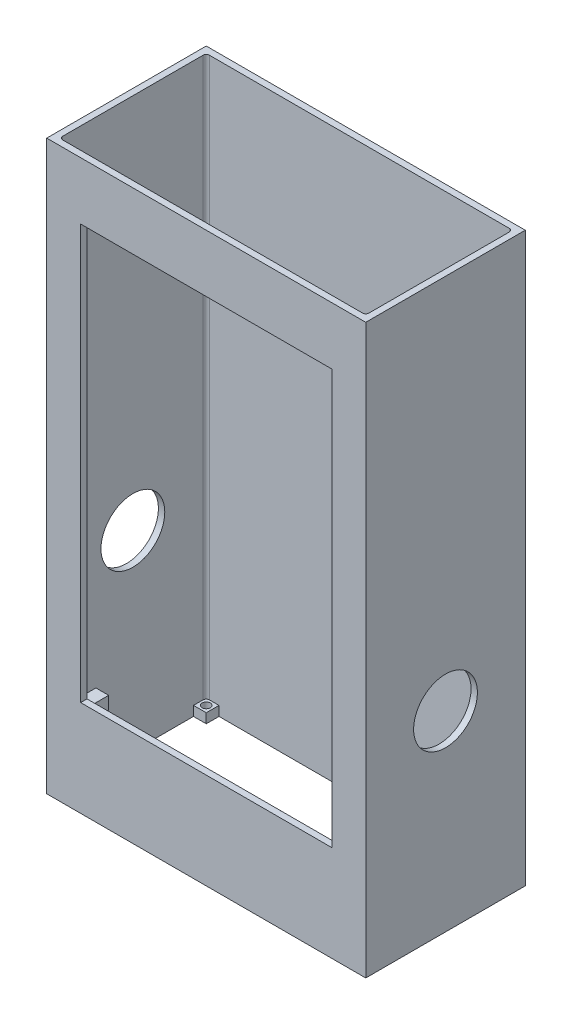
ISO-10303-21;
HEADER;
FILE_DESCRIPTION(('STEP AP214'),'2;1');
FILE_NAME('part.step','',(''),(''),'','','');
FILE_SCHEMA(('AUTOMOTIVE_DESIGN { 1 0 10303 214 1 1 1 1 }'));
ENDSEC;
DATA;
#1=APPLICATION_CONTEXT('core data for automotive mechanical design processes');
#2=APPLICATION_PROTOCOL_DEFINITION('international standard','automotive_design',2000,#1);
#3=PRODUCT_CONTEXT('',#1,'mechanical');
#4=PRODUCT('Part','Part','',(#3));
#5=PRODUCT_RELATED_PRODUCT_CATEGORY('part','',(#4));
#6=PRODUCT_DEFINITION_FORMATION('','',#4);
#7=PRODUCT_DEFINITION_CONTEXT('part definition',#1,'design');
#8=PRODUCT_DEFINITION('design','',#6,#7);
#9=PRODUCT_DEFINITION_SHAPE('','',#8);
#10=(LENGTH_UNIT() NAMED_UNIT(*) SI_UNIT(.MILLI.,.METRE.));
#11=(NAMED_UNIT(*) PLANE_ANGLE_UNIT() SI_UNIT($,.RADIAN.));
#12=(NAMED_UNIT(*) SI_UNIT($,.STERADIAN.) SOLID_ANGLE_UNIT());
#13=UNCERTAINTY_MEASURE_WITH_UNIT(LENGTH_MEASURE(1.E-05),#10,'distance_accuracy_value','');
#14=(GEOMETRIC_REPRESENTATION_CONTEXT(3) GLOBAL_UNCERTAINTY_ASSIGNED_CONTEXT((#13)) GLOBAL_UNIT_ASSIGNED_CONTEXT((#10,
#11,#12)) REPRESENTATION_CONTEXT('',''));
#15=CARTESIAN_POINT('',(0.,0.,0.));
#16=DIRECTION('',(0.,0.,1.));
#17=DIRECTION('',(1.,0.,0.));
#18=AXIS2_PLACEMENT_3D('',#15,#16,#17);
#19=CARTESIAN_POINT('',(124.46,-2.53999999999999,0.));
#20=DIRECTION('',(1.,0.,0.));
#21=DIRECTION('',(0.,0.,-1.));
#22=AXIS2_PLACEMENT_3D('',#19,#20,#21);
#23=PLANE('',#22);
#24=CARTESIAN_POINT('',(124.46,-152.4,-31.75));
#25=DIRECTION('',(1.,0.,0.));
#26=DIRECTION('',(0.,0.,-1.));
#27=AXIS2_PLACEMENT_3D('',#24,#25,#26);
#28=CIRCLE('',#27,12.7);
#29=CARTESIAN_POINT('',(124.46,-152.4,-44.45));
#30=VERTEX_POINT('',#29);
#31=EDGE_CURVE('E789',#30,#30,#28,.T.);
#32=ORIENTED_EDGE('',*,*,#31,.T.);
#33=EDGE_LOOP('',(#32));
#34=FACE_BOUND('',#33,.T.);
#35=DIRECTION('',(0.,-1.,0.));
#36=VECTOR('',#35,1.);
#37=CARTESIAN_POINT('',(124.46,-224.79,-7.62));
#38=LINE('',#37,#36);
#39=CARTESIAN_POINT('',(124.46,-224.79,-7.62));
#40=VERTEX_POINT('',#39);
#41=CARTESIAN_POINT('',(124.46,-228.6,-7.62));
#42=VERTEX_POINT('',#41);
#43=EDGE_CURVE('E87',#40,#42,#38,.T.);
#44=ORIENTED_EDGE('',*,*,#43,.F.);
#45=DIRECTION('',(0.,0.,-1.));
#46=VECTOR('',#45,1.);
#47=CARTESIAN_POINT('',(124.46,-224.79,0.));
#48=LINE('',#47,#46);
#49=CARTESIAN_POINT('',(124.46,-224.79,-3.81));
#50=VERTEX_POINT('',#49);
#51=EDGE_CURVE('E352',#50,#40,#48,.T.);
#52=ORIENTED_EDGE('',*,*,#51,.F.);
#53=DIRECTION('',(0.,-1.,0.));
#54=VECTOR('',#53,1.);
#55=CARTESIAN_POINT('',(124.46,-2.53999999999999,-3.81));
#56=LINE('',#55,#54);
#57=CARTESIAN_POINT('',(124.46,-2.53999999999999,-3.81));
#58=VERTEX_POINT('',#57);
#59=EDGE_CURVE('E849',#50,#58,#56,.F.);
#60=ORIENTED_EDGE('',*,*,#59,.T.);
#61=DIRECTION('',(0.,0.,1.));
#62=VECTOR('',#61,1.);
#63=CARTESIAN_POINT('',(124.46,-2.53999999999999,0.));
#64=LINE('',#63,#62);
#65=CARTESIAN_POINT('',(124.46,-2.53999999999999,-59.69));
#66=VERTEX_POINT('',#65);
#67=EDGE_CURVE('E802',#66,#58,#64,.T.);
#68=ORIENTED_EDGE('',*,*,#67,.F.);
#69=DIRECTION('',(0.,-1.,0.));
#70=VECTOR('',#69,1.);
#71=CARTESIAN_POINT('',(124.46,-302.26,-59.69));
#72=LINE('',#71,#70);
#73=CARTESIAN_POINT('',(124.46,-224.79,-59.69));
#74=VERTEX_POINT('',#73);
#75=EDGE_CURVE('E855',#66,#74,#72,.T.);
#76=ORIENTED_EDGE('',*,*,#75,.T.);
#77=DIRECTION('',(0.,0.,-1.));
#78=VECTOR('',#77,1.);
#79=CARTESIAN_POINT('',(124.46,-224.79,0.));
#80=LINE('',#79,#78);
#81=CARTESIAN_POINT('',(124.46,-224.79,-55.88));
#82=VERTEX_POINT('',#81);
#83=EDGE_CURVE('E410',#82,#74,#80,.T.);
#84=ORIENTED_EDGE('',*,*,#83,.F.);
#85=DIRECTION('',(0.,-1.,0.));
#86=VECTOR('',#85,1.);
#87=CARTESIAN_POINT('',(124.46,-224.79,-55.88));
#88=LINE('',#87,#86);
#89=CARTESIAN_POINT('',(124.46,-228.6,-55.88));
#90=VERTEX_POINT('',#89);
#91=EDGE_CURVE('E433',#82,#90,#88,.T.);
#92=ORIENTED_EDGE('',*,*,#91,.T.);
#93=DIRECTION('',(0.,0.,1.));
#94=VECTOR('',#93,1.);
#95=CARTESIAN_POINT('',(124.46,-228.6,0.));
#96=LINE('',#95,#94);
#97=EDGE_CURVE('E530',#90,#42,#96,.T.);
#98=ORIENTED_EDGE('',*,*,#97,.T.);
#99=EDGE_LOOP('',(#44,#52,#60,#68,#76,#84,#92,#98));
#100=FACE_BOUND('',#99,.T.);
#101=ADVANCED_FACE('F63',(#34,#100),#23,.F.);
#102=CARTESIAN_POINT('',(123.19,-2.53999999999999,-3.81));
#103=DIRECTION('',(0.,-1.,0.));
#104=DIRECTION('',(0.,0.,-1.));
#105=AXIS2_PLACEMENT_3D('',#102,#103,#104);
#106=CYLINDRICAL_SURFACE('',#105,1.27);
#107=CARTESIAN_POINT('',(123.19,-224.79,-3.81));
#108=DIRECTION('',(0.,-1.,0.));
#109=DIRECTION('',(0.,0.,-1.));
#110=AXIS2_PLACEMENT_3D('',#107,#108,#109);
#111=CIRCLE('',#110,1.27);
#112=CARTESIAN_POINT('',(123.19,-224.79,-2.54));
#113=VERTEX_POINT('',#112);
#114=EDGE_CURVE('E377',#113,#50,#111,.F.);
#115=ORIENTED_EDGE('',*,*,#114,.F.);
#116=DIRECTION('',(0.,-1.,0.));
#117=VECTOR('',#116,1.);
#118=CARTESIAN_POINT('',(123.19,-2.53999999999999,-2.54));
#119=LINE('',#118,#117);
#120=CARTESIAN_POINT('',(123.19,-2.53999999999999,-2.54));
#121=VERTEX_POINT('',#120);
#122=EDGE_CURVE('E846',#121,#113,#119,.T.);
#123=ORIENTED_EDGE('',*,*,#122,.F.);
#124=CARTESIAN_POINT('',(123.19,-2.53999999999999,-3.81));
#125=DIRECTION('',(0.,-1.,0.));
#126=DIRECTION('',(0.,0.,-1.));
#127=AXIS2_PLACEMENT_3D('',#124,#125,#126);
#128=CIRCLE('',#127,1.27);
#129=EDGE_CURVE('E852',#58,#121,#128,.T.);
#130=ORIENTED_EDGE('',*,*,#129,.F.);
#131=ORIENTED_EDGE('',*,*,#59,.F.);
#132=EDGE_LOOP('',(#115,#123,#130,#131));
#133=FACE_BOUND('',#132,.T.);
#134=ADVANCED_FACE('F925',(#133),#106,.F.);
#135=CARTESIAN_POINT('',(0.,-2.53999999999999,-60.96));
#136=DIRECTION('',(0.,0.,-1.));
#137=DIRECTION('',(-1.,0.,0.));
#138=AXIS2_PLACEMENT_3D('',#135,#136,#137);
#139=PLANE('',#138);
#140=DIRECTION('',(0.,-1.,0.));
#141=VECTOR('',#140,1.);
#142=CARTESIAN_POINT('',(119.38,-224.79,-60.96));
#143=LINE('',#142,#141);
#144=CARTESIAN_POINT('',(119.38,-224.79,-60.96));
#145=VERTEX_POINT('',#144);
#146=CARTESIAN_POINT('',(119.38,-228.6,-60.96));
#147=VERTEX_POINT('',#146);
#148=EDGE_CURVE('E418',#145,#147,#143,.T.);
#149=ORIENTED_EDGE('',*,*,#148,.F.);
#150=DIRECTION('',(-1.,0.,0.));
#151=VECTOR('',#150,1.);
#152=CARTESIAN_POINT('',(0.,-224.79,-60.96));
#153=LINE('',#152,#151);
#154=CARTESIAN_POINT('',(123.19,-224.79,-60.96));
#155=VERTEX_POINT('',#154);
#156=EDGE_CURVE('E402',#155,#145,#153,.T.);
#157=ORIENTED_EDGE('',*,*,#156,.F.);
#158=DIRECTION('',(0.,-1.,0.));
#159=VECTOR('',#158,1.);
#160=CARTESIAN_POINT('',(123.19,-2.53999999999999,-60.96));
#161=LINE('',#160,#159);
#162=CARTESIAN_POINT('',(123.19,-2.53999999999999,-60.96));
#163=VERTEX_POINT('',#162);
#164=EDGE_CURVE('E859',#155,#163,#161,.F.);
#165=ORIENTED_EDGE('',*,*,#164,.T.);
#166=DIRECTION('',(1.,0.,0.));
#167=VECTOR('',#166,1.);
#168=CARTESIAN_POINT('',(0.,-2.53999999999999,-60.96));
#169=LINE('',#168,#167);
#170=CARTESIAN_POINT('',(3.81,-2.53999999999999,-60.96));
#171=VERTEX_POINT('',#170);
#172=EDGE_CURVE('E798',#171,#163,#169,.T.);
#173=ORIENTED_EDGE('',*,*,#172,.F.);
#174=DIRECTION('',(0.,-1.,0.));
#175=VECTOR('',#174,1.);
#176=CARTESIAN_POINT('',(3.81,-2.53999999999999,-60.96));
#177=LINE('',#176,#175);
#178=CARTESIAN_POINT('',(3.81,-224.79,-60.96));
#179=VERTEX_POINT('',#178);
#180=EDGE_CURVE('E818',#171,#179,#177,.T.);
#181=ORIENTED_EDGE('',*,*,#180,.T.);
#182=DIRECTION('',(-1.,0.,0.));
#183=VECTOR('',#182,1.);
#184=CARTESIAN_POINT('',(0.,-224.79,-60.96));
#185=LINE('',#184,#183);
#186=CARTESIAN_POINT('',(7.62,-224.79,-60.96));
#187=VERTEX_POINT('',#186);
#188=EDGE_CURVE('E443',#187,#179,#185,.T.);
#189=ORIENTED_EDGE('',*,*,#188,.F.);
#190=DIRECTION('',(0.,-1.,0.));
#191=VECTOR('',#190,1.);
#192=CARTESIAN_POINT('',(7.62,-224.79,-60.96));
#193=LINE('',#192,#191);
#194=CARTESIAN_POINT('',(7.62,-228.6,-60.96));
#195=VERTEX_POINT('',#194);
#196=EDGE_CURVE('E460',#187,#195,#193,.T.);
#197=ORIENTED_EDGE('',*,*,#196,.T.);
#198=DIRECTION('',(1.,0.,0.));
#199=VECTOR('',#198,1.);
#200=CARTESIAN_POINT('',(0.,-228.6,-60.96));
#201=LINE('',#200,#199);
#202=EDGE_CURVE('E536',#195,#147,#201,.T.);
#203=ORIENTED_EDGE('',*,*,#202,.T.);
#204=EDGE_LOOP('',(#149,#157,#165,#173,#181,#189,#197,#203));
#205=FACE_BOUND('',#204,.T.);
#206=ADVANCED_FACE('F931',(#205),#139,.F.);
#207=CARTESIAN_POINT('',(123.19,-2.53999999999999,-59.69));
#208=DIRECTION('',(0.,1.,0.));
#209=DIRECTION('',(0.,0.,1.));
#210=AXIS2_PLACEMENT_3D('',#207,#208,#209);
#211=CYLINDRICAL_SURFACE('',#210,1.27);
#212=CARTESIAN_POINT('',(123.19,-224.79,-59.69));
#213=DIRECTION('',(0.,-1.,0.));
#214=DIRECTION('',(0.,0.,-1.));
#215=AXIS2_PLACEMENT_3D('',#212,#213,#214);
#216=CIRCLE('',#215,1.27);
#217=EDGE_CURVE('E406',#74,#155,#216,.F.);
#218=ORIENTED_EDGE('',*,*,#217,.F.);
#219=ORIENTED_EDGE('',*,*,#75,.F.);
#220=CARTESIAN_POINT('',(123.19,-2.53999999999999,-59.69));
#221=DIRECTION('',(0.,-1.,0.));
#222=DIRECTION('',(0.,0.,-1.));
#223=AXIS2_PLACEMENT_3D('',#220,#221,#222);
#224=CIRCLE('',#223,1.27);
#225=EDGE_CURVE('E862',#163,#66,#224,.T.);
#226=ORIENTED_EDGE('',*,*,#225,.F.);
#227=ORIENTED_EDGE('',*,*,#164,.F.);
#228=EDGE_LOOP('',(#218,#219,#226,#227));
#229=FACE_BOUND('',#228,.T.);
#230=ADVANCED_FACE('F65',(#229),#211,.F.);
#231=CARTESIAN_POINT('',(2.54,-2.53999999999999,0.));
#232=DIRECTION('',(1.,0.,0.));
#233=DIRECTION('',(0.,0.,-1.));
#234=AXIS2_PLACEMENT_3D('',#231,#232,#233);
#235=PLANE('',#234);
#236=CARTESIAN_POINT('',(2.53999999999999,-152.4,-31.75));
#237=DIRECTION('',(1.,0.,0.));
#238=DIRECTION('',(0.,0.,-1.));
#239=AXIS2_PLACEMENT_3D('',#236,#237,#238);
#240=CIRCLE('',#239,12.7);
#241=CARTESIAN_POINT('',(2.53999999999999,-152.4,-44.45));
#242=VERTEX_POINT('',#241);
#243=EDGE_CURVE('E790',#242,#242,#240,.T.);
#244=ORIENTED_EDGE('',*,*,#243,.F.);
#245=EDGE_LOOP('',(#244));
#246=FACE_BOUND('',#245,.T.);
#247=DIRECTION('',(0.,0.,1.));
#248=VECTOR('',#247,1.);
#249=CARTESIAN_POINT('',(2.54,-228.6,0.));
#250=LINE('',#249,#248);
#251=CARTESIAN_POINT('',(2.54,-228.6,-55.88));
#252=VERTEX_POINT('',#251);
#253=CARTESIAN_POINT('',(2.54,-228.6,-7.62));
#254=VERTEX_POINT('',#253);
#255=EDGE_CURVE('E539',#252,#254,#250,.T.);
#256=ORIENTED_EDGE('',*,*,#255,.F.);
#257=DIRECTION('',(0.,-1.,0.));
#258=VECTOR('',#257,1.);
#259=CARTESIAN_POINT('',(2.54,-224.79,-55.88));
#260=LINE('',#259,#258);
#261=CARTESIAN_POINT('',(2.54,-224.79,-55.88));
#262=VERTEX_POINT('',#261);
#263=EDGE_CURVE('E471',#262,#252,#260,.T.);
#264=ORIENTED_EDGE('',*,*,#263,.F.);
#265=DIRECTION('',(0.,0.,1.));
#266=VECTOR('',#265,1.);
#267=CARTESIAN_POINT('',(2.54,-224.79,0.));
#268=LINE('',#267,#266);
#269=CARTESIAN_POINT('',(2.54,-224.79,-59.69));
#270=VERTEX_POINT('',#269);
#271=EDGE_CURVE('E454',#270,#262,#268,.T.);
#272=ORIENTED_EDGE('',*,*,#271,.F.);
#273=DIRECTION('',(0.,-1.,0.));
#274=VECTOR('',#273,1.);
#275=CARTESIAN_POINT('',(2.54,-2.53999999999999,-59.69));
#276=LINE('',#275,#274);
#277=CARTESIAN_POINT('',(2.54,-2.53999999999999,-59.69));
#278=VERTEX_POINT('',#277);
#279=EDGE_CURVE('E830',#270,#278,#276,.F.);
#280=ORIENTED_EDGE('',*,*,#279,.T.);
#281=DIRECTION('',(0.,0.,1.));
#282=VECTOR('',#281,1.);
#283=CARTESIAN_POINT('',(2.54,-2.53999999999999,0.));
#284=LINE('',#283,#282);
#285=CARTESIAN_POINT('',(2.54,-2.53999999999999,-3.81));
#286=VERTEX_POINT('',#285);
#287=EDGE_CURVE('E810',#278,#286,#284,.T.);
#288=ORIENTED_EDGE('',*,*,#287,.T.);
#289=DIRECTION('',(0.,-1.,0.));
#290=VECTOR('',#289,1.);
#291=CARTESIAN_POINT('',(2.54,-302.26,-3.81));
#292=LINE('',#291,#290);
#293=CARTESIAN_POINT('',(2.54,-224.79,-3.81));
#294=VERTEX_POINT('',#293);
#295=EDGE_CURVE('E836',#286,#294,#292,.T.);
#296=ORIENTED_EDGE('',*,*,#295,.T.);
#297=DIRECTION('',(0.,0.,1.));
#298=VECTOR('',#297,1.);
#299=CARTESIAN_POINT('',(2.54,-224.79,0.));
#300=LINE('',#299,#298);
#301=CARTESIAN_POINT('',(2.54,-224.79,-7.62));
#302=VERTEX_POINT('',#301);
#303=EDGE_CURVE('E499',#302,#294,#300,.T.);
#304=ORIENTED_EDGE('',*,*,#303,.F.);
#305=DIRECTION('',(0.,-1.,0.));
#306=VECTOR('',#305,1.);
#307=CARTESIAN_POINT('',(2.54,-224.79,-7.62));
#308=LINE('',#307,#306);
#309=EDGE_CURVE('E512',#302,#254,#308,.T.);
#310=ORIENTED_EDGE('',*,*,#309,.T.);
#311=EDGE_LOOP('',(#256,#264,#272,#280,#288,#296,#304,#310));
#312=FACE_BOUND('',#311,.T.);
#313=ADVANCED_FACE('F957',(#246,#312),#235,.T.);
#314=CARTESIAN_POINT('',(3.81,-2.53999999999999,-59.69));
#315=DIRECTION('',(0.,-1.,0.));
#316=DIRECTION('',(0.,0.,-1.));
#317=AXIS2_PLACEMENT_3D('',#314,#315,#316);
#318=CYLINDRICAL_SURFACE('',#317,1.27);
#319=CARTESIAN_POINT('',(3.81,-224.79,-59.69));
#320=DIRECTION('',(0.,-1.,0.));
#321=DIRECTION('',(0.,0.,-1.));
#322=AXIS2_PLACEMENT_3D('',#319,#320,#321);
#323=CIRCLE('',#322,1.27);
#324=EDGE_CURVE('E457',#179,#270,#323,.F.);
#325=ORIENTED_EDGE('',*,*,#324,.F.);
#326=ORIENTED_EDGE('',*,*,#180,.F.);
#327=CARTESIAN_POINT('',(3.81,-2.53999999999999,-59.69));
#328=DIRECTION('',(0.,-1.,0.));
#329=DIRECTION('',(0.,0.,-1.));
#330=AXIS2_PLACEMENT_3D('',#327,#328,#329);
#331=CIRCLE('',#330,1.27);
#332=EDGE_CURVE('E833',#278,#171,#331,.T.);
#333=ORIENTED_EDGE('',*,*,#332,.F.);
#334=ORIENTED_EDGE('',*,*,#279,.F.);
#335=EDGE_LOOP('',(#325,#326,#333,#334));
#336=FACE_BOUND('',#335,.T.);
#337=ADVANCED_FACE('F954',(#336),#318,.F.);
#338=CARTESIAN_POINT('',(0.,-2.53999999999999,-2.54));
#339=DIRECTION('',(0.,0.,-1.));
#340=DIRECTION('',(-1.,0.,0.));
#341=AXIS2_PLACEMENT_3D('',#338,#339,#340);
#342=PLANE('',#341);
#343=DIRECTION('',(0.,-1.,0.));
#344=VECTOR('',#343,1.);
#345=CARTESIAN_POINT('',(119.38,-224.79,-2.54));
#346=LINE('',#345,#344);
#347=CARTESIAN_POINT('',(119.38,-224.79,-2.54));
#348=VERTEX_POINT('',#347);
#349=CARTESIAN_POINT('',(119.38,-228.6,-2.54));
#350=VERTEX_POINT('',#349);
#351=EDGE_CURVE('E365',#348,#350,#346,.T.);
#352=ORIENTED_EDGE('',*,*,#351,.T.);
#353=DIRECTION('',(1.,0.,0.));
#354=VECTOR('',#353,1.);
#355=CARTESIAN_POINT('',(0.,-228.6,-2.54));
#356=LINE('',#355,#354);
#357=CARTESIAN_POINT('',(7.61999999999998,-228.6,-2.54));
#358=VERTEX_POINT('',#357);
#359=EDGE_CURVE('E542',#358,#350,#356,.T.);
#360=ORIENTED_EDGE('',*,*,#359,.F.);
#361=DIRECTION('',(0.,-1.,0.));
#362=VECTOR('',#361,1.);
#363=CARTESIAN_POINT('',(7.62,-224.79,-2.54));
#364=LINE('',#363,#362);
#365=CARTESIAN_POINT('',(7.62,-224.79,-2.54));
#366=VERTEX_POINT('',#365);
#367=EDGE_CURVE('E517',#366,#358,#364,.T.);
#368=ORIENTED_EDGE('',*,*,#367,.F.);
#369=DIRECTION('',(1.,0.,0.));
#370=VECTOR('',#369,1.);
#371=CARTESIAN_POINT('',(0.,-224.79,-2.54));
#372=LINE('',#371,#370);
#373=CARTESIAN_POINT('',(3.81,-224.79,-2.54));
#374=VERTEX_POINT('',#373);
#375=EDGE_CURVE('E493',#374,#366,#372,.T.);
#376=ORIENTED_EDGE('',*,*,#375,.F.);
#377=DIRECTION('',(0.,-1.,0.));
#378=VECTOR('',#377,1.);
#379=CARTESIAN_POINT('',(3.81,-2.53999999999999,-2.54));
#380=LINE('',#379,#378);
#381=CARTESIAN_POINT('',(3.81,-2.53999999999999,-2.54));
#382=VERTEX_POINT('',#381);
#383=EDGE_CURVE('E840',#374,#382,#380,.F.);
#384=ORIENTED_EDGE('',*,*,#383,.T.);
#385=DIRECTION('',(1.,0.,0.));
#386=VECTOR('',#385,1.);
#387=CARTESIAN_POINT('',(0.,-2.53999999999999,-2.54));
#388=LINE('',#387,#386);
#389=EDGE_CURVE('E806',#382,#121,#388,.T.);
#390=ORIENTED_EDGE('',*,*,#389,.T.);
#391=ORIENTED_EDGE('',*,*,#122,.T.);
#392=DIRECTION('',(1.,0.,0.));
#393=VECTOR('',#392,1.);
#394=CARTESIAN_POINT('',(0.,-224.79,-2.54));
#395=LINE('',#394,#393);
#396=EDGE_CURVE('E79',#348,#113,#395,.T.);
#397=ORIENTED_EDGE('',*,*,#396,.F.);
#398=EDGE_LOOP('',(#352,#360,#368,#376,#384,#390,#391,#397));
#399=FACE_BOUND('',#398,.T.);
#400=DIRECTION('',(1.,0.,0.));
#401=VECTOR('',#400,1.);
#402=CARTESIAN_POINT('',(0.,-17.860000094,-2.54));
#403=LINE('',#402,#401);
#404=CARTESIAN_POINT('',(112.884000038,-17.860000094,-2.54));
#405=VERTEX_POINT('',#404);
#406=CARTESIAN_POINT('',(117.964000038,-17.860000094,-2.54));
#407=VERTEX_POINT('',#406);
#408=EDGE_CURVE('E669',#405,#407,#403,.T.);
#409=ORIENTED_EDGE('',*,*,#408,.F.);
#410=DIRECTION('',(0.,1.,0.));
#411=VECTOR('',#410,1.);
#412=CARTESIAN_POINT('',(112.884000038,0.,-2.54));
#413=LINE('',#412,#411);
#414=CARTESIAN_POINT('',(112.884000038,-22.940000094,-2.54));
#415=VERTEX_POINT('',#414);
#416=EDGE_CURVE('E644',#415,#405,#413,.T.);
#417=ORIENTED_EDGE('',*,*,#416,.F.);
#418=DIRECTION('',(1.,0.,0.));
#419=VECTOR('',#418,1.);
#420=CARTESIAN_POINT('',(0.,-22.940000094,-2.54));
#421=LINE('',#420,#419);
#422=CARTESIAN_POINT('',(117.964000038,-22.940000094,-2.54));
#423=VERTEX_POINT('',#422);
#424=EDGE_CURVE('E650',#415,#423,#421,.T.);
#425=ORIENTED_EDGE('',*,*,#424,.T.);
#426=DIRECTION('',(0.,1.,0.));
#427=VECTOR('',#426,1.);
#428=CARTESIAN_POINT('',(117.964000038,0.,-2.54));
#429=LINE('',#428,#427);
#430=EDGE_CURVE('E673',#423,#407,#429,.T.);
#431=ORIENTED_EDGE('',*,*,#430,.T.);
#432=EDGE_LOOP('',(#409,#417,#425,#431));
#433=FACE_BOUND('',#432,.T.);
#434=DIRECTION('',(0.,1.,0.));
#435=VECTOR('',#434,1.);
#436=CARTESIAN_POINT('',(14.1160384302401,-22.940000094,-2.54));
#437=LINE('',#436,#435);
#438=CARTESIAN_POINT('',(14.1160384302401,-22.940000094,-2.54));
#439=VERTEX_POINT('',#438);
#440=CARTESIAN_POINT('',(14.1160384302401,-17.860000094,-2.54));
#441=VERTEX_POINT('',#440);
#442=EDGE_CURVE('E702',#439,#441,#437,.T.);
#443=ORIENTED_EDGE('',*,*,#442,.T.);
#444=DIRECTION('',(-1.,0.,0.));
#445=VECTOR('',#444,1.);
#446=CARTESIAN_POINT('',(11.5760384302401,-17.860000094,-2.54));
#447=LINE('',#446,#445);
#448=CARTESIAN_POINT('',(9.03603843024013,-17.860000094,-2.54));
#449=VERTEX_POINT('',#448);
#450=EDGE_CURVE('E697',#441,#449,#447,.T.);
#451=ORIENTED_EDGE('',*,*,#450,.T.);
#452=DIRECTION('',(0.,-1.,0.));
#453=VECTOR('',#452,1.);
#454=CARTESIAN_POINT('',(9.03603843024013,-17.860000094,-2.54));
#455=LINE('',#454,#453);
#456=CARTESIAN_POINT('',(9.03603843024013,-22.940000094,-2.54));
#457=VERTEX_POINT('',#456);
#458=EDGE_CURVE('E717',#449,#457,#455,.T.);
#459=ORIENTED_EDGE('',*,*,#458,.T.);
#460=DIRECTION('',(1.,0.,0.));
#461=VECTOR('',#460,1.);
#462=CARTESIAN_POINT('',(9.03603843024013,-22.940000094,-2.54));
#463=LINE('',#462,#461);
#464=EDGE_CURVE('E720',#457,#439,#463,.T.);
#465=ORIENTED_EDGE('',*,*,#464,.T.);
#466=EDGE_LOOP('',(#443,#451,#459,#465));
#467=FACE_BOUND('',#466,.T.);
#468=DIRECTION('',(-1.,0.,0.));
#469=VECTOR('',#468,1.);
#470=CARTESIAN_POINT('',(0.,-190.399999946,-2.54));
#471=LINE('',#470,#469);
#472=CARTESIAN_POINT('',(113.500000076,-190.399999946,-2.54));
#473=VERTEX_POINT('',#472);
#474=CARTESIAN_POINT('',(13.499999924,-190.399999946,-2.54));
#475=VERTEX_POINT('',#474);
#476=EDGE_CURVE('E878',#473,#475,#471,.T.);
#477=ORIENTED_EDGE('',*,*,#476,.F.);
#478=DIRECTION('',(0.,-1.,0.));
#479=VECTOR('',#478,1.);
#480=CARTESIAN_POINT('',(113.500000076,-2.53999999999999,-2.54));
#481=LINE('',#480,#479);
#482=CARTESIAN_POINT('',(113.500000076,-25.4,-2.54));
#483=VERTEX_POINT('',#482);
#484=EDGE_CURVE('E875',#483,#473,#481,.T.);
#485=ORIENTED_EDGE('',*,*,#484,.F.);
#486=DIRECTION('',(1.,0.,0.));
#487=VECTOR('',#486,1.);
#488=CARTESIAN_POINT('',(0.,-25.4,-2.54));
#489=LINE('',#488,#487);
#490=CARTESIAN_POINT('',(13.499999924,-25.4,-2.54));
#491=VERTEX_POINT('',#490);
#492=EDGE_CURVE('E872',#491,#483,#489,.T.);
#493=ORIENTED_EDGE('',*,*,#492,.F.);
#494=DIRECTION('',(0.,-1.,0.));
#495=VECTOR('',#494,1.);
#496=CARTESIAN_POINT('',(13.499999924,-2.53999999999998,-2.54));
#497=LINE('',#496,#495);
#498=EDGE_CURVE('E865',#491,#475,#497,.T.);
#499=ORIENTED_EDGE('',*,*,#498,.T.);
#500=EDGE_LOOP('',(#477,#485,#493,#499));
#501=FACE_BOUND('',#500,.T.);
#502=DIRECTION('',(0.,-1.,0.));
#503=VECTOR('',#502,1.);
#504=CARTESIAN_POINT('',(112.884000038,0.,-2.54));
#505=LINE('',#504,#503);
#506=CARTESIAN_POINT('',(112.884000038,-192.859999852,-2.54));
#507=VERTEX_POINT('',#506);
#508=CARTESIAN_POINT('',(112.884000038,-197.939999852,-2.54));
#509=VERTEX_POINT('',#508);
#510=EDGE_CURVE('E595',#507,#509,#505,.T.);
#511=ORIENTED_EDGE('',*,*,#510,.T.);
#512=DIRECTION('',(1.,0.,0.));
#513=VECTOR('',#512,1.);
#514=CARTESIAN_POINT('',(0.,-197.939999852,-2.54));
#515=LINE('',#514,#513);
#516=CARTESIAN_POINT('',(117.964000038,-197.939999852,-2.54));
#517=VERTEX_POINT('',#516);
#518=EDGE_CURVE('E601',#509,#517,#515,.T.);
#519=ORIENTED_EDGE('',*,*,#518,.T.);
#520=DIRECTION('',(0.,-1.,0.));
#521=VECTOR('',#520,1.);
#522=CARTESIAN_POINT('',(117.964000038,0.,-2.54));
#523=LINE('',#522,#521);
#524=CARTESIAN_POINT('',(117.964000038,-192.859999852,-2.54));
#525=VERTEX_POINT('',#524);
#526=EDGE_CURVE('E623',#525,#517,#523,.T.);
#527=ORIENTED_EDGE('',*,*,#526,.F.);
#528=DIRECTION('',(1.,0.,0.));
#529=VECTOR('',#528,1.);
#530=CARTESIAN_POINT('',(0.,-192.859999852,-2.54));
#531=LINE('',#530,#529);
#532=EDGE_CURVE('E619',#507,#525,#531,.T.);
#533=ORIENTED_EDGE('',*,*,#532,.F.);
#534=EDGE_LOOP('',(#511,#519,#527,#533));
#535=FACE_BOUND('',#534,.T.);
#536=DIRECTION('',(0.,-1.,0.));
#537=VECTOR('',#536,1.);
#538=CARTESIAN_POINT('',(9.03599996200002,0.,-2.54));
#539=LINE('',#538,#537);
#540=CARTESIAN_POINT('',(9.03599996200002,-192.859999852,-2.54));
#541=VERTEX_POINT('',#540);
#542=CARTESIAN_POINT('',(9.03599996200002,-197.939999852,-2.54));
#543=VERTEX_POINT('',#542);
#544=EDGE_CURVE('E549',#541,#543,#539,.T.);
#545=ORIENTED_EDGE('',*,*,#544,.T.);
#546=DIRECTION('',(-1.,0.,0.));
#547=VECTOR('',#546,1.);
#548=CARTESIAN_POINT('',(0.,-197.939999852,-2.54));
#549=LINE('',#548,#547);
#550=CARTESIAN_POINT('',(14.115999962,-197.939999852,-2.54));
#551=VERTEX_POINT('',#550);
#552=EDGE_CURVE('E555',#551,#543,#549,.T.);
#553=ORIENTED_EDGE('',*,*,#552,.F.);
#554=DIRECTION('',(0.,-1.,0.));
#555=VECTOR('',#554,1.);
#556=CARTESIAN_POINT('',(14.115999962,0.,-2.54));
#557=LINE('',#556,#555);
#558=CARTESIAN_POINT('',(14.115999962,-192.859999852,-2.54));
#559=VERTEX_POINT('',#558);
#560=EDGE_CURVE('E577',#559,#551,#557,.T.);
#561=ORIENTED_EDGE('',*,*,#560,.F.);
#562=DIRECTION('',(-1.,0.,0.));
#563=VECTOR('',#562,1.);
#564=CARTESIAN_POINT('',(0.,-192.859999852,-2.54));
#565=LINE('',#564,#563);
#566=EDGE_CURVE('E573',#559,#541,#565,.T.);
#567=ORIENTED_EDGE('',*,*,#566,.T.);
#568=EDGE_LOOP('',(#545,#553,#561,#567));
#569=FACE_BOUND('',#568,.T.);
#570=ADVANCED_FACE('F923',(#399,#433,#467,#501,#535,#569),#342,.T.);
#571=CARTESIAN_POINT('',(3.81,-2.53999999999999,-3.81));
#572=DIRECTION('',(0.,1.,0.));
#573=DIRECTION('',(0.,0.,1.));
#574=AXIS2_PLACEMENT_3D('',#571,#572,#573);
#575=CYLINDRICAL_SURFACE('',#574,1.27);
#576=CARTESIAN_POINT('',(3.81,-224.79,-3.81));
#577=DIRECTION('',(0.,-1.,0.));
#578=DIRECTION('',(0.,0.,-1.));
#579=AXIS2_PLACEMENT_3D('',#576,#577,#578);
#580=CIRCLE('',#579,1.27);
#581=EDGE_CURVE('E496',#294,#374,#580,.F.);
#582=ORIENTED_EDGE('',*,*,#581,.F.);
#583=ORIENTED_EDGE('',*,*,#295,.F.);
#584=CARTESIAN_POINT('',(3.81,-2.53999999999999,-3.81));
#585=DIRECTION('',(0.,-1.,0.));
#586=DIRECTION('',(0.,0.,-1.));
#587=AXIS2_PLACEMENT_3D('',#584,#585,#586);
#588=CIRCLE('',#587,1.27);
#589=EDGE_CURVE('E843',#382,#286,#588,.T.);
#590=ORIENTED_EDGE('',*,*,#589,.F.);
#591=ORIENTED_EDGE('',*,*,#383,.F.);
#592=EDGE_LOOP('',(#582,#583,#590,#591));
#593=FACE_BOUND('',#592,.T.);
#594=ADVANCED_FACE('F952',(#593),#575,.F.);
#595=CARTESIAN_POINT('',(0.,-302.26,0.));
#596=DIRECTION('',(-1.,0.,0.));
#597=DIRECTION('',(0.,0.,1.));
#598=AXIS2_PLACEMENT_3D('',#595,#596,#597);
#599=PLANE('',#598);
#600=DIRECTION('',(0.,0.,-1.));
#601=VECTOR('',#600,1.);
#602=CARTESIAN_POINT('',(0.,-228.6,0.));
#603=LINE('',#602,#601);
#604=CARTESIAN_POINT('',(0.,-228.6,0.));
#605=VERTEX_POINT('',#604);
#606=CARTESIAN_POINT('',(0.,-228.6,-63.5));
#607=VERTEX_POINT('',#606);
#608=EDGE_CURVE('E546',#605,#607,#603,.T.);
#609=ORIENTED_EDGE('',*,*,#608,.F.);
#610=DIRECTION('',(0.,1.,0.));
#611=VECTOR('',#610,1.);
#612=CARTESIAN_POINT('',(0.,-302.26,0.));
#613=LINE('',#612,#611);
#614=CARTESIAN_POINT('',(0.,-2.53999999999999,0.));
#615=VERTEX_POINT('',#614);
#616=EDGE_CURVE('E814',#605,#615,#613,.T.);
#617=ORIENTED_EDGE('',*,*,#616,.T.);
#618=DIRECTION('',(0.,0.,1.));
#619=VECTOR('',#618,1.);
#620=CARTESIAN_POINT('',(0.,-2.54,0.));
#621=LINE('',#620,#619);
#622=CARTESIAN_POINT('',(0.,-2.54,-63.5));
#623=VERTEX_POINT('',#622);
#624=EDGE_CURVE('E769',#623,#615,#621,.T.);
#625=ORIENTED_EDGE('',*,*,#624,.F.);
#626=DIRECTION('',(0.,1.,0.));
#627=VECTOR('',#626,1.);
#628=CARTESIAN_POINT('',(0.,-302.26,-63.5));
#629=LINE('',#628,#627);
#630=EDGE_CURVE('E815',#607,#623,#629,.T.);
#631=ORIENTED_EDGE('',*,*,#630,.F.);
#632=EDGE_LOOP('',(#609,#617,#625,#631));
#633=FACE_BOUND('',#632,.T.);
#634=CARTESIAN_POINT('',(0.,-152.4,-31.75));
#635=DIRECTION('',(-1.,0.,0.));
#636=DIRECTION('',(0.,0.,1.));
#637=AXIS2_PLACEMENT_3D('',#634,#635,#636);
#638=CIRCLE('',#637,12.7);
#639=CARTESIAN_POINT('',(0.,-152.4,-19.05));
#640=VERTEX_POINT('',#639);
#641=EDGE_CURVE('E785',#640,#640,#638,.T.);
#642=ORIENTED_EDGE('',*,*,#641,.F.);
#643=EDGE_LOOP('',(#642));
#644=FACE_BOUND('',#643,.T.);
#645=ADVANCED_FACE('F941',(#633,#644),#599,.T.);
#646=CARTESIAN_POINT('',(0.,-302.26,-63.5));
#647=DIRECTION('',(0.,0.,-1.));
#648=DIRECTION('',(-1.,0.,0.));
#649=AXIS2_PLACEMENT_3D('',#646,#647,#648);
#650=PLANE('',#649);
#651=DIRECTION('',(1.,0.,0.));
#652=VECTOR('',#651,1.);
#653=CARTESIAN_POINT('',(-127.,-228.6,-63.5));
#654=LINE('',#653,#652);
#655=CARTESIAN_POINT('',(127.,-228.6,-63.5));
#656=VERTEX_POINT('',#655);
#657=EDGE_CURVE('E527',#607,#656,#654,.T.);
#658=ORIENTED_EDGE('',*,*,#657,.F.);
#659=ORIENTED_EDGE('',*,*,#630,.T.);
#660=DIRECTION('',(-1.,0.,0.));
#661=VECTOR('',#660,1.);
#662=CARTESIAN_POINT('',(0.,-2.54,-63.5));
#663=LINE('',#662,#661);
#664=CARTESIAN_POINT('',(127.,-2.54,-63.5));
#665=VERTEX_POINT('',#664);
#666=EDGE_CURVE('E781',#665,#623,#663,.T.);
#667=ORIENTED_EDGE('',*,*,#666,.F.);
#668=DIRECTION('',(0.,1.,0.));
#669=VECTOR('',#668,1.);
#670=CARTESIAN_POINT('',(127.,-302.26,-63.5));
#671=LINE('',#670,#669);
#672=EDGE_CURVE('E819',#656,#665,#671,.T.);
#673=ORIENTED_EDGE('',*,*,#672,.F.);
#674=EDGE_LOOP('',(#658,#659,#667,#673));
#675=FACE_BOUND('',#674,.T.);
#676=ADVANCED_FACE('F937',(#675),#650,.T.);
#677=CARTESIAN_POINT('',(127.,-302.26,0.));
#678=DIRECTION('',(1.,0.,0.));
#679=DIRECTION('',(0.,0.,-1.));
#680=AXIS2_PLACEMENT_3D('',#677,#678,#679);
#681=PLANE('',#680);
#682=DIRECTION('',(0.,0.,1.));
#683=VECTOR('',#682,1.);
#684=CARTESIAN_POINT('',(127.,-228.6,-63.5));
#685=LINE('',#684,#683);
#686=CARTESIAN_POINT('',(127.,-228.6,0.));
#687=VERTEX_POINT('',#686);
#688=EDGE_CURVE('E516',#656,#687,#685,.T.);
#689=ORIENTED_EDGE('',*,*,#688,.F.);
#690=ORIENTED_EDGE('',*,*,#672,.T.);
#691=DIRECTION('',(0.,0.,-1.));
#692=VECTOR('',#691,1.);
#693=CARTESIAN_POINT('',(127.,-2.54,0.));
#694=LINE('',#693,#692);
#695=CARTESIAN_POINT('',(127.,-2.54,0.));
#696=VERTEX_POINT('',#695);
#697=EDGE_CURVE('E777',#696,#665,#694,.T.);
#698=ORIENTED_EDGE('',*,*,#697,.F.);
#699=DIRECTION('',(0.,1.,0.));
#700=VECTOR('',#699,1.);
#701=CARTESIAN_POINT('',(127.,-302.26,0.));
#702=LINE('',#701,#700);
#703=EDGE_CURVE('E822',#687,#696,#702,.T.);
#704=ORIENTED_EDGE('',*,*,#703,.F.);
#705=EDGE_LOOP('',(#689,#690,#698,#704));
#706=FACE_BOUND('',#705,.T.);
#707=CARTESIAN_POINT('',(127.,-152.4,-31.75));
#708=DIRECTION('',(1.,0.,0.));
#709=DIRECTION('',(0.,0.,-1.));
#710=AXIS2_PLACEMENT_3D('',#707,#708,#709);
#711=CIRCLE('',#710,12.7);
#712=CARTESIAN_POINT('',(127.,-152.4,-44.45));
#713=VERTEX_POINT('',#712);
#714=EDGE_CURVE('E794',#713,#713,#711,.T.);
#715=ORIENTED_EDGE('',*,*,#714,.F.);
#716=EDGE_LOOP('',(#715));
#717=FACE_BOUND('',#716,.T.);
#718=ADVANCED_FACE('F940',(#706,#717),#681,.T.);
#719=CARTESIAN_POINT('',(0.,-302.26,0.));
#720=DIRECTION('',(0.,0.,1.));
#721=DIRECTION('',(1.,0.,0.));
#722=AXIS2_PLACEMENT_3D('',#719,#720,#721);
#723=PLANE('',#722);
#724=DIRECTION('',(1.,0.,0.));
#725=VECTOR('',#724,1.);
#726=CARTESIAN_POINT('',(-127.,-228.6,0.));
#727=LINE('',#726,#725);
#728=EDGE_CURVE('E526',#605,#687,#727,.T.);
#729=ORIENTED_EDGE('',*,*,#728,.T.);
#730=ORIENTED_EDGE('',*,*,#703,.T.);
#731=DIRECTION('',(1.,0.,0.));
#732=VECTOR('',#731,1.);
#733=CARTESIAN_POINT('',(0.,-2.54,0.));
#734=LINE('',#733,#732);
#735=EDGE_CURVE('E773',#615,#696,#734,.T.);
#736=ORIENTED_EDGE('',*,*,#735,.F.);
#737=ORIENTED_EDGE('',*,*,#616,.F.);
#738=EDGE_LOOP('',(#729,#730,#736,#737));
#739=FACE_BOUND('',#738,.T.);
#740=DIRECTION('',(1.,0.,0.));
#741=VECTOR('',#740,1.);
#742=CARTESIAN_POINT('',(0.,-190.399999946,0.));
#743=LINE('',#742,#741);
#744=CARTESIAN_POINT('',(13.499999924,-190.399999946,0.));
#745=VERTEX_POINT('',#744);
#746=CARTESIAN_POINT('',(113.500000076,-190.399999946,0.));
#747=VERTEX_POINT('',#746);
#748=EDGE_CURVE('E766',#745,#747,#743,.T.);
#749=ORIENTED_EDGE('',*,*,#748,.F.);
#750=DIRECTION('',(0.,1.,0.));
#751=VECTOR('',#750,1.);
#752=CARTESIAN_POINT('',(13.499999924,-302.26,0.));
#753=LINE('',#752,#751);
#754=CARTESIAN_POINT('',(13.499999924,-25.4,0.));
#755=VERTEX_POINT('',#754);
#756=EDGE_CURVE('E755',#745,#755,#753,.T.);
#757=ORIENTED_EDGE('',*,*,#756,.T.);
#758=DIRECTION('',(-1.,0.,0.));
#759=VECTOR('',#758,1.);
#760=CARTESIAN_POINT('',(0.,-25.4,0.));
#761=LINE('',#760,#759);
#762=CARTESIAN_POINT('',(113.500000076,-25.4,0.));
#763=VERTEX_POINT('',#762);
#764=EDGE_CURVE('E759',#763,#755,#761,.T.);
#765=ORIENTED_EDGE('',*,*,#764,.F.);
#766=DIRECTION('',(0.,1.,0.));
#767=VECTOR('',#766,1.);
#768=CARTESIAN_POINT('',(113.500000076,-302.26,0.));
#769=LINE('',#768,#767);
#770=EDGE_CURVE('E763',#747,#763,#769,.T.);
#771=ORIENTED_EDGE('',*,*,#770,.F.);
#772=EDGE_LOOP('',(#749,#757,#765,#771));
#773=FACE_BOUND('',#772,.T.);
#774=ADVANCED_FACE('F945',(#739,#773),#723,.T.);
#775=CARTESIAN_POINT('',(254.,-152.4,-31.75));
#776=DIRECTION('',(-1.,0.,0.));
#777=DIRECTION('',(0.,0.,1.));
#778=AXIS2_PLACEMENT_3D('',#775,#776,#777);
#779=CYLINDRICAL_SURFACE('',#778,12.7);
#780=ORIENTED_EDGE('',*,*,#714,.T.);
#781=EDGE_LOOP('',(#780));
#782=FACE_BOUND('',#781,.T.);
#783=ORIENTED_EDGE('',*,*,#31,.F.);
#784=EDGE_LOOP('',(#783));
#785=FACE_BOUND('',#784,.T.);
#786=ADVANCED_FACE('F948',(#782,#785),#779,.F.);
#787=ORIENTED_EDGE('',*,*,#243,.T.);
#788=EDGE_LOOP('',(#787));
#789=FACE_BOUND('',#788,.T.);
#790=ORIENTED_EDGE('',*,*,#641,.T.);
#791=EDGE_LOOP('',(#790));
#792=FACE_BOUND('',#791,.T.);
#793=ADVANCED_FACE('F1166',(#789,#792),#779,.F.);
#794=CARTESIAN_POINT('',(0.,-2.54,0.));
#795=DIRECTION('',(0.,-1.,0.));
#796=DIRECTION('',(0.,0.,-1.));
#797=AXIS2_PLACEMENT_3D('',#794,#795,#796);
#798=PLANE('',#797);
#799=ORIENTED_EDGE('',*,*,#172,.T.);
#800=ORIENTED_EDGE('',*,*,#225,.T.);
#801=ORIENTED_EDGE('',*,*,#67,.T.);
#802=ORIENTED_EDGE('',*,*,#129,.T.);
#803=ORIENTED_EDGE('',*,*,#389,.F.);
#804=ORIENTED_EDGE('',*,*,#589,.T.);
#805=ORIENTED_EDGE('',*,*,#287,.F.);
#806=ORIENTED_EDGE('',*,*,#332,.T.);
#807=EDGE_LOOP('',(#799,#800,#801,#802,#803,#804,#805,#806));
#808=FACE_BOUND('',#807,.T.);
#809=ORIENTED_EDGE('',*,*,#624,.T.);
#810=ORIENTED_EDGE('',*,*,#735,.T.);
#811=ORIENTED_EDGE('',*,*,#697,.T.);
#812=ORIENTED_EDGE('',*,*,#666,.T.);
#813=EDGE_LOOP('',(#809,#810,#811,#812));
#814=FACE_BOUND('',#813,.T.);
#815=ADVANCED_FACE('F979',(#808,#814),#798,.F.);
#816=CARTESIAN_POINT('',(0.,-190.399999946,8.12799999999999));
#817=DIRECTION('',(0.,-1.,0.));
#818=DIRECTION('',(0.,0.,-1.));
#819=AXIS2_PLACEMENT_3D('',#816,#817,#818);
#820=PLANE('',#819);
#821=ORIENTED_EDGE('',*,*,#748,.T.);
#822=DIRECTION('',(0.,0.,-1.));
#823=VECTOR('',#822,1.);
#824=CARTESIAN_POINT('',(113.500000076,-190.399999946,8.12799999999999));
#825=LINE('',#824,#823);
#826=EDGE_CURVE('E751',#747,#473,#825,.T.);
#827=ORIENTED_EDGE('',*,*,#826,.T.);
#828=ORIENTED_EDGE('',*,*,#476,.T.);
#829=DIRECTION('',(0.,0.,-1.));
#830=VECTOR('',#829,1.);
#831=CARTESIAN_POINT('',(13.499999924,-190.399999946,8.12799999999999));
#832=LINE('',#831,#830);
#833=EDGE_CURVE('E729',#745,#475,#832,.T.);
#834=ORIENTED_EDGE('',*,*,#833,.F.);
#835=EDGE_LOOP('',(#821,#827,#828,#834));
#836=FACE_BOUND('',#835,.T.);
#837=ADVANCED_FACE('F1159',(#836),#820,.F.);
#838=CARTESIAN_POINT('',(113.500000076,0.,8.12799999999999));
#839=DIRECTION('',(1.,0.,0.));
#840=DIRECTION('',(0.,0.,-1.));
#841=AXIS2_PLACEMENT_3D('',#838,#839,#840);
#842=PLANE('',#841);
#843=ORIENTED_EDGE('',*,*,#770,.T.);
#844=DIRECTION('',(0.,0.,-1.));
#845=VECTOR('',#844,1.);
#846=CARTESIAN_POINT('',(113.500000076,-25.4,8.12799999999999));
#847=LINE('',#846,#845);
#848=EDGE_CURVE('E747',#763,#483,#847,.T.);
#849=ORIENTED_EDGE('',*,*,#848,.T.);
#850=ORIENTED_EDGE('',*,*,#484,.T.);
#851=ORIENTED_EDGE('',*,*,#826,.F.);
#852=EDGE_LOOP('',(#843,#849,#850,#851));
#853=FACE_BOUND('',#852,.T.);
#854=ADVANCED_FACE('F1155',(#853),#842,.F.);
#855=CARTESIAN_POINT('',(0.,-25.4,8.12799999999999));
#856=DIRECTION('',(0.,1.,0.));
#857=DIRECTION('',(0.,0.,1.));
#858=AXIS2_PLACEMENT_3D('',#855,#856,#857);
#859=PLANE('',#858);
#860=ORIENTED_EDGE('',*,*,#764,.T.);
#861=DIRECTION('',(0.,0.,-1.));
#862=VECTOR('',#861,1.);
#863=CARTESIAN_POINT('',(13.499999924,-25.4,8.12799999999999));
#864=LINE('',#863,#862);
#865=EDGE_CURVE('E743',#755,#491,#864,.T.);
#866=ORIENTED_EDGE('',*,*,#865,.T.);
#867=ORIENTED_EDGE('',*,*,#492,.T.);
#868=ORIENTED_EDGE('',*,*,#848,.F.);
#869=EDGE_LOOP('',(#860,#866,#867,#868));
#870=FACE_BOUND('',#869,.T.);
#871=ADVANCED_FACE('F1151',(#870),#859,.F.);
#872=CARTESIAN_POINT('',(13.499999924,0.,8.12799999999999));
#873=DIRECTION('',(1.,0.,0.));
#874=DIRECTION('',(0.,1.,0.));
#875=AXIS2_PLACEMENT_3D('',#872,#873,#874);
#876=PLANE('',#875);
#877=ORIENTED_EDGE('',*,*,#833,.T.);
#878=ORIENTED_EDGE('',*,*,#498,.F.);
#879=ORIENTED_EDGE('',*,*,#865,.F.);
#880=ORIENTED_EDGE('',*,*,#756,.F.);
#881=EDGE_LOOP('',(#877,#878,#879,#880));
#882=FACE_BOUND('',#881,.T.);
#883=ADVANCED_FACE('F1133',(#882),#876,.T.);
#884=CARTESIAN_POINT('',(0.,0.,-10.540000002));
#885=DIRECTION('',(0.,0.,1.));
#886=DIRECTION('',(1.,0.,0.));
#887=AXIS2_PLACEMENT_3D('',#884,#885,#886);
#888=PLANE('',#887);
#889=DIRECTION('',(-1.,0.,0.));
#890=VECTOR('',#889,1.);
#891=CARTESIAN_POINT('',(14.1160384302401,-17.860000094,-10.540000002));
#892=LINE('',#891,#890);
#893=CARTESIAN_POINT('',(14.1160384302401,-17.860000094,-10.540000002));
#894=VERTEX_POINT('',#893);
#895=CARTESIAN_POINT('',(9.03603843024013,-17.860000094,-10.540000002));
#896=VERTEX_POINT('',#895);
#897=EDGE_CURVE('E698',#894,#896,#892,.T.);
#898=ORIENTED_EDGE('',*,*,#897,.F.);
#899=DIRECTION('',(0.,1.,0.));
#900=VECTOR('',#899,1.);
#901=CARTESIAN_POINT('',(14.1160384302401,-22.940000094,-10.540000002));
#902=LINE('',#901,#900);
#903=CARTESIAN_POINT('',(14.1160384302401,-22.940000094,-10.540000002));
#904=VERTEX_POINT('',#903);
#905=EDGE_CURVE('E710',#904,#894,#902,.T.);
#906=ORIENTED_EDGE('',*,*,#905,.F.);
#907=DIRECTION('',(1.,0.,0.));
#908=VECTOR('',#907,1.);
#909=CARTESIAN_POINT('',(9.03603843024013,-22.940000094,-10.540000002));
#910=LINE('',#909,#908);
#911=CARTESIAN_POINT('',(9.03603843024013,-22.940000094,-10.540000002));
#912=VERTEX_POINT('',#911);
#913=EDGE_CURVE('E706',#912,#904,#910,.T.);
#914=ORIENTED_EDGE('',*,*,#913,.F.);
#915=DIRECTION('',(0.,-1.,0.));
#916=VECTOR('',#915,1.);
#917=CARTESIAN_POINT('',(9.03603843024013,-17.860000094,-10.540000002));
#918=LINE('',#917,#916);
#919=EDGE_CURVE('E701',#896,#912,#918,.T.);
#920=ORIENTED_EDGE('',*,*,#919,.F.);
#921=EDGE_LOOP('',(#898,#906,#914,#920));
#922=FACE_BOUND('',#921,.T.);
#923=CARTESIAN_POINT('',(11.5760384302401,-20.400000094,-10.540000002));
#924=DIRECTION('',(0.,0.,-1.));
#925=DIRECTION('',(-1.,0.,0.));
#926=AXIS2_PLACEMENT_3D('',#923,#924,#925);
#927=CIRCLE('',#926,1.600000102);
#928=CARTESIAN_POINT('',(9.97603832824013,-20.400000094,-10.540000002));
#929=VERTEX_POINT('',#928);
#930=EDGE_CURVE('E693',#929,#929,#927,.T.);
#931=ORIENTED_EDGE('',*,*,#930,.F.);
#932=EDGE_LOOP('',(#931));
#933=FACE_BOUND('',#932,.T.);
#934=ADVANCED_FACE('F1129',(#922,#933),#888,.F.);
#935=CARTESIAN_POINT('',(14.1160384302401,-22.940000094,-10.540000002));
#936=DIRECTION('',(1.,0.,0.));
#937=DIRECTION('',(0.,0.,-1.));
#938=AXIS2_PLACEMENT_3D('',#935,#936,#937);
#939=PLANE('',#938);
#940=ORIENTED_EDGE('',*,*,#442,.F.);
#941=DIRECTION('',(0.,0.,1.));
#942=VECTOR('',#941,1.);
#943=CARTESIAN_POINT('',(14.1160384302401,-22.940000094,-10.540000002));
#944=LINE('',#943,#942);
#945=EDGE_CURVE('E730',#904,#439,#944,.T.);
#946=ORIENTED_EDGE('',*,*,#945,.F.);
#947=ORIENTED_EDGE('',*,*,#905,.T.);
#948=DIRECTION('',(0.,0.,1.));
#949=VECTOR('',#948,1.);
#950=CARTESIAN_POINT('',(14.1160384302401,-17.860000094,-10.540000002));
#951=LINE('',#950,#949);
#952=EDGE_CURVE('E725',#894,#441,#951,.T.);
#953=ORIENTED_EDGE('',*,*,#952,.T.);
#954=EDGE_LOOP('',(#940,#946,#947,#953));
#955=FACE_BOUND('',#954,.T.);
#956=ADVANCED_FACE('F1132',(#955),#939,.T.);
#957=CARTESIAN_POINT('',(9.03603843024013,-22.940000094,-10.540000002));
#958=DIRECTION('',(0.,-1.,0.));
#959=DIRECTION('',(0.,0.,-1.));
#960=AXIS2_PLACEMENT_3D('',#957,#958,#959);
#961=PLANE('',#960);
#962=ORIENTED_EDGE('',*,*,#464,.F.);
#963=DIRECTION('',(0.,0.,1.));
#964=VECTOR('',#963,1.);
#965=CARTESIAN_POINT('',(9.03603843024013,-22.940000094,-10.540000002));
#966=LINE('',#965,#964);
#967=EDGE_CURVE('E734',#912,#457,#966,.T.);
#968=ORIENTED_EDGE('',*,*,#967,.F.);
#969=ORIENTED_EDGE('',*,*,#913,.T.);
#970=ORIENTED_EDGE('',*,*,#945,.T.);
#971=EDGE_LOOP('',(#962,#968,#969,#970));
#972=FACE_BOUND('',#971,.T.);
#973=ADVANCED_FACE('F1137',(#972),#961,.T.);
#974=CARTESIAN_POINT('',(9.03603843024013,-17.860000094,-10.540000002));
#975=DIRECTION('',(-1.,0.,0.));
#976=DIRECTION('',(0.,0.,1.));
#977=AXIS2_PLACEMENT_3D('',#974,#975,#976);
#978=PLANE('',#977);
#979=ORIENTED_EDGE('',*,*,#458,.F.);
#980=DIRECTION('',(0.,0.,1.));
#981=VECTOR('',#980,1.);
#982=CARTESIAN_POINT('',(9.03603843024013,-17.860000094,-10.540000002));
#983=LINE('',#982,#981);
#984=EDGE_CURVE('E714',#896,#449,#983,.T.);
#985=ORIENTED_EDGE('',*,*,#984,.F.);
#986=ORIENTED_EDGE('',*,*,#919,.T.);
#987=ORIENTED_EDGE('',*,*,#967,.T.);
#988=EDGE_LOOP('',(#979,#985,#986,#987));
#989=FACE_BOUND('',#988,.T.);
#990=ADVANCED_FACE('F1141',(#989),#978,.T.);
#991=CARTESIAN_POINT('',(11.5760384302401,-17.860000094,-10.540000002));
#992=DIRECTION('',(0.,1.,0.));
#993=DIRECTION('',(0.,0.,1.));
#994=AXIS2_PLACEMENT_3D('',#991,#992,#993);
#995=PLANE('',#994);
#996=ORIENTED_EDGE('',*,*,#450,.F.);
#997=ORIENTED_EDGE('',*,*,#952,.F.);
#998=ORIENTED_EDGE('',*,*,#897,.T.);
#999=ORIENTED_EDGE('',*,*,#984,.T.);
#1000=EDGE_LOOP('',(#996,#997,#998,#999));
#1001=FACE_BOUND('',#1000,.T.);
#1002=ADVANCED_FACE('F1127',(#1001),#995,.T.);
#1003=CARTESIAN_POINT('',(11.5760384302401,-20.400000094,-10.540000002));
#1004=DIRECTION('',(0.,0.,1.));
#1005=DIRECTION('',(1.,0.,0.));
#1006=AXIS2_PLACEMENT_3D('',#1003,#1004,#1005);
#1007=CYLINDRICAL_SURFACE('',#1006,1.600000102);
#1008=ORIENTED_EDGE('',*,*,#930,.T.);
#1009=EDGE_LOOP('',(#1008));
#1010=FACE_BOUND('',#1009,.T.);
#1011=CARTESIAN_POINT('',(11.5760384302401,-20.400000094,-2.54));
#1012=DIRECTION('',(0.,0.,-1.));
#1013=DIRECTION('',(-1.,0.,0.));
#1014=AXIS2_PLACEMENT_3D('',#1011,#1012,#1013);
#1015=CIRCLE('',#1014,1.600000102);
#1016=CARTESIAN_POINT('',(9.97603832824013,-20.400000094,-2.54));
#1017=VERTEX_POINT('',#1016);
#1018=EDGE_CURVE('E882',#1017,#1017,#1015,.F.);
#1019=ORIENTED_EDGE('',*,*,#1018,.T.);
#1020=EDGE_LOOP('',(#1019));
#1021=FACE_BOUND('',#1020,.T.);
#1022=ADVANCED_FACE('F917',(#1010,#1021),#1007,.F.);
#1023=ORIENTED_EDGE('',*,*,#1018,.F.);
#1024=EDGE_LOOP('',(#1023));
#1025=FACE_BOUND('',#1024,.T.);
#1026=ADVANCED_FACE('F900',(#1025),#342,.T.);
#1027=CARTESIAN_POINT('',(112.884000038,0.,-10.53999924));
#1028=DIRECTION('',(1.,0.,0.));
#1029=DIRECTION('',(0.,0.,-1.));
#1030=AXIS2_PLACEMENT_3D('',#1027,#1028,#1029);
#1031=PLANE('',#1030);
#1032=ORIENTED_EDGE('',*,*,#416,.T.);
#1033=DIRECTION('',(0.,0.,1.));
#1034=VECTOR('',#1033,1.);
#1035=CARTESIAN_POINT('',(112.884000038,-17.860000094,-10.53999924));
#1036=LINE('',#1035,#1034);
#1037=CARTESIAN_POINT('',(112.884000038,-17.860000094,-10.53999924));
#1038=VERTEX_POINT('',#1037);
#1039=EDGE_CURVE('E689',#1038,#405,#1036,.T.);
#1040=ORIENTED_EDGE('',*,*,#1039,.F.);
#1041=DIRECTION('',(0.,1.,0.));
#1042=VECTOR('',#1041,1.);
#1043=CARTESIAN_POINT('',(112.884000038,0.,-10.53999924));
#1044=LINE('',#1043,#1042);
#1045=CARTESIAN_POINT('',(112.884000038,-22.940000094,-10.53999924));
#1046=VERTEX_POINT('',#1045);
#1047=EDGE_CURVE('E649',#1046,#1038,#1044,.T.);
#1048=ORIENTED_EDGE('',*,*,#1047,.F.);
#1049=DIRECTION('',(0.,0.,1.));
#1050=VECTOR('',#1049,1.);
#1051=CARTESIAN_POINT('',(112.884000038,-22.940000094,-10.53999924));
#1052=LINE('',#1051,#1050);
#1053=EDGE_CURVE('E665',#1046,#415,#1052,.T.);
#1054=ORIENTED_EDGE('',*,*,#1053,.T.);
#1055=EDGE_LOOP('',(#1032,#1040,#1048,#1054));
#1056=FACE_BOUND('',#1055,.T.);
#1057=ADVANCED_FACE('F916',(#1056),#1031,.F.);
#1058=CARTESIAN_POINT('',(0.,-17.860000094,-10.53999924));
#1059=DIRECTION('',(0.,-1.,0.));
#1060=DIRECTION('',(0.,0.,-1.));
#1061=AXIS2_PLACEMENT_3D('',#1058,#1059,#1060);
#1062=PLANE('',#1061);
#1063=ORIENTED_EDGE('',*,*,#408,.T.);
#1064=DIRECTION('',(0.,0.,1.));
#1065=VECTOR('',#1064,1.);
#1066=CARTESIAN_POINT('',(117.964000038,-17.860000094,-10.53999924));
#1067=LINE('',#1066,#1065);
#1068=CARTESIAN_POINT('',(117.964000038,-17.860000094,-10.53999924));
#1069=VERTEX_POINT('',#1068);
#1070=EDGE_CURVE('E685',#1069,#407,#1067,.T.);
#1071=ORIENTED_EDGE('',*,*,#1070,.F.);
#1072=DIRECTION('',(1.,0.,0.));
#1073=VECTOR('',#1072,1.);
#1074=CARTESIAN_POINT('',(0.,-17.860000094,-10.53999924));
#1075=LINE('',#1074,#1073);
#1076=EDGE_CURVE('E654',#1038,#1069,#1075,.T.);
#1077=ORIENTED_EDGE('',*,*,#1076,.F.);
#1078=ORIENTED_EDGE('',*,*,#1039,.T.);
#1079=EDGE_LOOP('',(#1063,#1071,#1077,#1078));
#1080=FACE_BOUND('',#1079,.T.);
#1081=ADVANCED_FACE('F1114',(#1080),#1062,.F.);
#1082=CARTESIAN_POINT('',(117.964000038,0.,-10.53999924));
#1083=DIRECTION('',(1.,0.,0.));
#1084=DIRECTION('',(0.,0.,-1.));
#1085=AXIS2_PLACEMENT_3D('',#1082,#1083,#1084);
#1086=PLANE('',#1085);
#1087=ORIENTED_EDGE('',*,*,#430,.F.);
#1088=DIRECTION('',(0.,0.,1.));
#1089=VECTOR('',#1088,1.);
#1090=CARTESIAN_POINT('',(117.964000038,-22.940000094,-10.53999924));
#1091=LINE('',#1090,#1089);
#1092=CARTESIAN_POINT('',(117.964000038,-22.940000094,-10.53999924));
#1093=VERTEX_POINT('',#1092);
#1094=EDGE_CURVE('E681',#1093,#423,#1091,.T.);
#1095=ORIENTED_EDGE('',*,*,#1094,.F.);
#1096=DIRECTION('',(0.,1.,0.));
#1097=VECTOR('',#1096,1.);
#1098=CARTESIAN_POINT('',(117.964000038,0.,-10.53999924));
#1099=LINE('',#1098,#1097);
#1100=EDGE_CURVE('E657',#1093,#1069,#1099,.T.);
#1101=ORIENTED_EDGE('',*,*,#1100,.T.);
#1102=ORIENTED_EDGE('',*,*,#1070,.T.);
#1103=EDGE_LOOP('',(#1087,#1095,#1101,#1102));
#1104=FACE_BOUND('',#1103,.T.);
#1105=ADVANCED_FACE('F1111',(#1104),#1086,.T.);
#1106=CARTESIAN_POINT('',(115.424000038,-20.400000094,-10.53999924));
#1107=DIRECTION('',(0.,0.,1.));
#1108=DIRECTION('',(1.,0.,0.));
#1109=AXIS2_PLACEMENT_3D('',#1106,#1107,#1108);
#1110=CYLINDRICAL_SURFACE('',#1109,1.60000010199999);
#1111=CARTESIAN_POINT('',(115.424000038,-20.400000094,-10.53999924));
#1112=DIRECTION('',(0.,0.,-1.));
#1113=DIRECTION('',(-1.,0.,0.));
#1114=AXIS2_PLACEMENT_3D('',#1111,#1112,#1113);
#1115=CIRCLE('',#1114,1.60000010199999);
#1116=CARTESIAN_POINT('',(113.823999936,-20.400000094,-10.53999924));
#1117=VERTEX_POINT('',#1116);
#1118=EDGE_CURVE('E645',#1117,#1117,#1115,.T.);
#1119=ORIENTED_EDGE('',*,*,#1118,.T.);
#1120=EDGE_LOOP('',(#1119));
#1121=FACE_BOUND('',#1120,.T.);
#1122=CARTESIAN_POINT('',(115.424000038,-20.400000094,-2.54));
#1123=DIRECTION('',(0.,0.,-1.));
#1124=DIRECTION('',(-1.,0.,0.));
#1125=AXIS2_PLACEMENT_3D('',#1122,#1123,#1124);
#1126=CIRCLE('',#1125,1.60000010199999);
#1127=CARTESIAN_POINT('',(113.823999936,-20.400000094,-2.54));
#1128=VERTEX_POINT('',#1127);
#1129=EDGE_CURVE('E886',#1128,#1128,#1126,.F.);
#1130=ORIENTED_EDGE('',*,*,#1129,.T.);
#1131=EDGE_LOOP('',(#1130));
#1132=FACE_BOUND('',#1131,.T.);
#1133=ADVANCED_FACE('F1109',(#1121,#1132),#1110,.F.);
#1134=CARTESIAN_POINT('',(0.,-22.940000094,-10.53999924));
#1135=DIRECTION('',(0.,-1.,0.));
#1136=DIRECTION('',(0.,0.,-1.));
#1137=AXIS2_PLACEMENT_3D('',#1134,#1135,#1136);
#1138=PLANE('',#1137);
#1139=ORIENTED_EDGE('',*,*,#424,.F.);
#1140=ORIENTED_EDGE('',*,*,#1053,.F.);
#1141=DIRECTION('',(1.,0.,0.));
#1142=VECTOR('',#1141,1.);
#1143=CARTESIAN_POINT('',(0.,-22.940000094,-10.53999924));
#1144=LINE('',#1143,#1142);
#1145=EDGE_CURVE('E661',#1046,#1093,#1144,.T.);
#1146=ORIENTED_EDGE('',*,*,#1145,.T.);
#1147=ORIENTED_EDGE('',*,*,#1094,.T.);
#1148=EDGE_LOOP('',(#1139,#1140,#1146,#1147));
#1149=FACE_BOUND('',#1148,.T.);
#1150=ADVANCED_FACE('F1105',(#1149),#1138,.T.);
#1151=CARTESIAN_POINT('',(0.,0.,-10.53999924));
#1152=DIRECTION('',(0.,0.,-1.));
#1153=DIRECTION('',(-1.,0.,0.));
#1154=AXIS2_PLACEMENT_3D('',#1151,#1152,#1153);
#1155=PLANE('',#1154);
#1156=ORIENTED_EDGE('',*,*,#1118,.F.);
#1157=EDGE_LOOP('',(#1156));
#1158=FACE_BOUND('',#1157,.T.);
#1159=ORIENTED_EDGE('',*,*,#1047,.T.);
#1160=ORIENTED_EDGE('',*,*,#1076,.T.);
#1161=ORIENTED_EDGE('',*,*,#1100,.F.);
#1162=ORIENTED_EDGE('',*,*,#1145,.F.);
#1163=EDGE_LOOP('',(#1159,#1160,#1161,#1162));
#1164=FACE_BOUND('',#1163,.T.);
#1165=ADVANCED_FACE('F1102',(#1158,#1164),#1155,.T.);
#1166=ORIENTED_EDGE('',*,*,#1129,.F.);
#1167=EDGE_LOOP('',(#1166));
#1168=FACE_BOUND('',#1167,.T.);
#1169=ADVANCED_FACE('F912',(#1168),#342,.T.);
#1170=CARTESIAN_POINT('',(112.884000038,0.,-10.53999924));
#1171=DIRECTION('',(-1.,0.,0.));
#1172=DIRECTION('',(0.,0.,1.));
#1173=AXIS2_PLACEMENT_3D('',#1170,#1171,#1172);
#1174=PLANE('',#1173);
#1175=ORIENTED_EDGE('',*,*,#510,.F.);
#1176=DIRECTION('',(0.,0.,1.));
#1177=VECTOR('',#1176,1.);
#1178=CARTESIAN_POINT('',(112.884000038,-192.859999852,-10.53999924));
#1179=LINE('',#1178,#1177);
#1180=CARTESIAN_POINT('',(112.884000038,-192.859999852,-10.53999924));
#1181=VERTEX_POINT('',#1180);
#1182=EDGE_CURVE('E640',#1181,#507,#1179,.T.);
#1183=ORIENTED_EDGE('',*,*,#1182,.F.);
#1184=DIRECTION('',(0.,-1.,0.));
#1185=VECTOR('',#1184,1.);
#1186=CARTESIAN_POINT('',(112.884000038,0.,-10.53999924));
#1187=LINE('',#1186,#1185);
#1188=CARTESIAN_POINT('',(112.884000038,-197.939999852,-10.53999924));
#1189=VERTEX_POINT('',#1188);
#1190=EDGE_CURVE('E600',#1181,#1189,#1187,.T.);
#1191=ORIENTED_EDGE('',*,*,#1190,.T.);
#1192=DIRECTION('',(0.,0.,1.));
#1193=VECTOR('',#1192,1.);
#1194=CARTESIAN_POINT('',(112.884000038,-197.939999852,-10.53999924));
#1195=LINE('',#1194,#1193);
#1196=EDGE_CURVE('E616',#1189,#509,#1195,.T.);
#1197=ORIENTED_EDGE('',*,*,#1196,.T.);
#1198=EDGE_LOOP('',(#1175,#1183,#1191,#1197));
#1199=FACE_BOUND('',#1198,.T.);
#1200=ADVANCED_FACE('F1094',(#1199),#1174,.T.);
#1201=CARTESIAN_POINT('',(0.,-192.859999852,-10.53999924));
#1202=DIRECTION('',(0.,-1.,0.));
#1203=DIRECTION('',(0.,0.,-1.));
#1204=AXIS2_PLACEMENT_3D('',#1201,#1202,#1203);
#1205=PLANE('',#1204);
#1206=ORIENTED_EDGE('',*,*,#532,.T.);
#1207=DIRECTION('',(0.,0.,1.));
#1208=VECTOR('',#1207,1.);
#1209=CARTESIAN_POINT('',(117.964000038,-192.859999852,-10.53999924));
#1210=LINE('',#1209,#1208);
#1211=CARTESIAN_POINT('',(117.964000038,-192.859999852,-10.53999924));
#1212=VERTEX_POINT('',#1211);
#1213=EDGE_CURVE('E636',#1212,#525,#1210,.T.);
#1214=ORIENTED_EDGE('',*,*,#1213,.F.);
#1215=DIRECTION('',(1.,0.,0.));
#1216=VECTOR('',#1215,1.);
#1217=CARTESIAN_POINT('',(0.,-192.859999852,-10.53999924));
#1218=LINE('',#1217,#1216);
#1219=EDGE_CURVE('E605',#1181,#1212,#1218,.T.);
#1220=ORIENTED_EDGE('',*,*,#1219,.F.);
#1221=ORIENTED_EDGE('',*,*,#1182,.T.);
#1222=EDGE_LOOP('',(#1206,#1214,#1220,#1221));
#1223=FACE_BOUND('',#1222,.T.);
#1224=ADVANCED_FACE('F1090',(#1223),#1205,.F.);
#1225=CARTESIAN_POINT('',(117.964000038,0.,-10.53999924));
#1226=DIRECTION('',(-1.,0.,0.));
#1227=DIRECTION('',(0.,0.,1.));
#1228=AXIS2_PLACEMENT_3D('',#1225,#1226,#1227);
#1229=PLANE('',#1228);
#1230=ORIENTED_EDGE('',*,*,#526,.T.);
#1231=DIRECTION('',(0.,0.,1.));
#1232=VECTOR('',#1231,1.);
#1233=CARTESIAN_POINT('',(117.964000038,-197.939999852,-10.53999924));
#1234=LINE('',#1233,#1232);
#1235=CARTESIAN_POINT('',(117.964000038,-197.939999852,-10.53999924));
#1236=VERTEX_POINT('',#1235);
#1237=EDGE_CURVE('E632',#1236,#517,#1234,.T.);
#1238=ORIENTED_EDGE('',*,*,#1237,.F.);
#1239=DIRECTION('',(0.,-1.,0.));
#1240=VECTOR('',#1239,1.);
#1241=CARTESIAN_POINT('',(117.964000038,0.,-10.53999924));
#1242=LINE('',#1241,#1240);
#1243=EDGE_CURVE('E609',#1212,#1236,#1242,.T.);
#1244=ORIENTED_EDGE('',*,*,#1243,.F.);
#1245=ORIENTED_EDGE('',*,*,#1213,.T.);
#1246=EDGE_LOOP('',(#1230,#1238,#1244,#1245));
#1247=FACE_BOUND('',#1246,.T.);
#1248=ADVANCED_FACE('F1087',(#1247),#1229,.F.);
#1249=CARTESIAN_POINT('',(115.424000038,-195.399999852,-10.53999924));
#1250=DIRECTION('',(0.,0.,1.));
#1251=DIRECTION('',(1.,0.,0.));
#1252=AXIS2_PLACEMENT_3D('',#1249,#1250,#1251);
#1253=CYLINDRICAL_SURFACE('',#1252,1.60000010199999);
#1254=CARTESIAN_POINT('',(115.424000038,-195.399999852,-10.53999924));
#1255=DIRECTION('',(0.,0.,-1.));
#1256=DIRECTION('',(-1.,0.,0.));
#1257=AXIS2_PLACEMENT_3D('',#1254,#1255,#1256);
#1258=CIRCLE('',#1257,1.60000010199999);
#1259=CARTESIAN_POINT('',(113.823999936,-195.399999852,-10.53999924));
#1260=VERTEX_POINT('',#1259);
#1261=EDGE_CURVE('E596',#1260,#1260,#1258,.T.);
#1262=ORIENTED_EDGE('',*,*,#1261,.T.);
#1263=EDGE_LOOP('',(#1262));
#1264=FACE_BOUND('',#1263,.T.);
#1265=CARTESIAN_POINT('',(115.424000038,-195.399999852,-2.54));
#1266=DIRECTION('',(0.,0.,-1.));
#1267=DIRECTION('',(-1.,0.,0.));
#1268=AXIS2_PLACEMENT_3D('',#1265,#1266,#1267);
#1269=CIRCLE('',#1268,1.60000010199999);
#1270=CARTESIAN_POINT('',(113.823999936,-195.399999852,-2.54));
#1271=VERTEX_POINT('',#1270);
#1272=EDGE_CURVE('E72',#1271,#1271,#1269,.F.);
#1273=ORIENTED_EDGE('',*,*,#1272,.T.);
#1274=EDGE_LOOP('',(#1273));
#1275=FACE_BOUND('',#1274,.T.);
#1276=ADVANCED_FACE('F893',(#1264,#1275),#1253,.F.);
#1277=CARTESIAN_POINT('',(0.,-197.939999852,-10.53999924));
#1278=DIRECTION('',(0.,-1.,0.));
#1279=DIRECTION('',(0.,0.,-1.));
#1280=AXIS2_PLACEMENT_3D('',#1277,#1278,#1279);
#1281=PLANE('',#1280);
#1282=ORIENTED_EDGE('',*,*,#518,.F.);
#1283=ORIENTED_EDGE('',*,*,#1196,.F.);
#1284=DIRECTION('',(1.,0.,0.));
#1285=VECTOR('',#1284,1.);
#1286=CARTESIAN_POINT('',(0.,-197.939999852,-10.53999924));
#1287=LINE('',#1286,#1285);
#1288=EDGE_CURVE('E612',#1189,#1236,#1287,.T.);
#1289=ORIENTED_EDGE('',*,*,#1288,.T.);
#1290=ORIENTED_EDGE('',*,*,#1237,.T.);
#1291=EDGE_LOOP('',(#1282,#1283,#1289,#1290));
#1292=FACE_BOUND('',#1291,.T.);
#1293=ADVANCED_FACE('F909',(#1292),#1281,.T.);
#1294=CARTESIAN_POINT('',(0.,0.,-10.53999924));
#1295=DIRECTION('',(0.,0.,-1.));
#1296=DIRECTION('',(-1.,0.,0.));
#1297=AXIS2_PLACEMENT_3D('',#1294,#1295,#1296);
#1298=PLANE('',#1297);
#1299=ORIENTED_EDGE('',*,*,#1261,.F.);
#1300=EDGE_LOOP('',(#1299));
#1301=FACE_BOUND('',#1300,.T.);
#1302=ORIENTED_EDGE('',*,*,#1190,.F.);
#1303=ORIENTED_EDGE('',*,*,#1219,.T.);
#1304=ORIENTED_EDGE('',*,*,#1243,.T.);
#1305=ORIENTED_EDGE('',*,*,#1288,.F.);
#1306=EDGE_LOOP('',(#1302,#1303,#1304,#1305));
#1307=FACE_BOUND('',#1306,.T.);
#1308=ADVANCED_FACE('F898',(#1301,#1307),#1298,.T.);
#1309=ORIENTED_EDGE('',*,*,#1272,.F.);
#1310=EDGE_LOOP('',(#1309));
#1311=FACE_BOUND('',#1310,.T.);
#1312=ADVANCED_FACE('F895',(#1311),#342,.T.);
#1313=CARTESIAN_POINT('',(9.03599996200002,0.,-10.53999924));
#1314=DIRECTION('',(-1.,0.,0.));
#1315=DIRECTION('',(0.,0.,1.));
#1316=AXIS2_PLACEMENT_3D('',#1313,#1314,#1315);
#1317=PLANE('',#1316);
#1318=ORIENTED_EDGE('',*,*,#544,.F.);
#1319=DIRECTION('',(0.,0.,1.));
#1320=VECTOR('',#1319,1.);
#1321=CARTESIAN_POINT('',(9.03599996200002,-192.859999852,-10.53999924));
#1322=LINE('',#1321,#1320);
#1323=CARTESIAN_POINT('',(9.03599996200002,-192.859999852,-10.53999924));
#1324=VERTEX_POINT('',#1323);
#1325=EDGE_CURVE('E592',#1324,#541,#1322,.T.);
#1326=ORIENTED_EDGE('',*,*,#1325,.F.);
#1327=DIRECTION('',(0.,-1.,0.));
#1328=VECTOR('',#1327,1.);
#1329=CARTESIAN_POINT('',(9.03599996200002,0.,-10.53999924));
#1330=LINE('',#1329,#1328);
#1331=CARTESIAN_POINT('',(9.03599996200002,-197.939999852,-10.53999924));
#1332=VERTEX_POINT('',#1331);
#1333=EDGE_CURVE('E550',#1324,#1332,#1330,.T.);
#1334=ORIENTED_EDGE('',*,*,#1333,.T.);
#1335=DIRECTION('',(0.,0.,1.));
#1336=VECTOR('',#1335,1.);
#1337=CARTESIAN_POINT('',(9.03599996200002,-197.939999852,-10.53999924));
#1338=LINE('',#1337,#1336);
#1339=EDGE_CURVE('E569',#1332,#543,#1338,.T.);
#1340=ORIENTED_EDGE('',*,*,#1339,.T.);
#1341=EDGE_LOOP('',(#1318,#1326,#1334,#1340));
#1342=FACE_BOUND('',#1341,.T.);
#1343=ADVANCED_FACE('F897',(#1342),#1317,.T.);
#1344=CARTESIAN_POINT('',(0.,-192.859999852,-10.53999924));
#1345=DIRECTION('',(0.,1.,0.));
#1346=DIRECTION('',(0.,0.,1.));
#1347=AXIS2_PLACEMENT_3D('',#1344,#1345,#1346);
#1348=PLANE('',#1347);
#1349=ORIENTED_EDGE('',*,*,#566,.F.);
#1350=DIRECTION('',(0.,0.,1.));
#1351=VECTOR('',#1350,1.);
#1352=CARTESIAN_POINT('',(14.115999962,-192.859999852,-10.53999924));
#1353=LINE('',#1352,#1351);
#1354=CARTESIAN_POINT('',(14.115999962,-192.859999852,-10.53999924));
#1355=VERTEX_POINT('',#1354);
#1356=EDGE_CURVE('E589',#1355,#559,#1353,.T.);
#1357=ORIENTED_EDGE('',*,*,#1356,.F.);
#1358=DIRECTION('',(-1.,0.,0.));
#1359=VECTOR('',#1358,1.);
#1360=CARTESIAN_POINT('',(0.,-192.859999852,-10.53999924));
#1361=LINE('',#1360,#1359);
#1362=EDGE_CURVE('E554',#1355,#1324,#1361,.T.);
#1363=ORIENTED_EDGE('',*,*,#1362,.T.);
#1364=ORIENTED_EDGE('',*,*,#1325,.T.);
#1365=EDGE_LOOP('',(#1349,#1357,#1363,#1364));
#1366=FACE_BOUND('',#1365,.T.);
#1367=ADVANCED_FACE('F906',(#1366),#1348,.T.);
#1368=CARTESIAN_POINT('',(14.115999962,0.,-10.53999924));
#1369=DIRECTION('',(-1.,0.,0.));
#1370=DIRECTION('',(0.,0.,1.));
#1371=AXIS2_PLACEMENT_3D('',#1368,#1369,#1370);
#1372=PLANE('',#1371);
#1373=ORIENTED_EDGE('',*,*,#560,.T.);
#1374=DIRECTION('',(0.,0.,1.));
#1375=VECTOR('',#1374,1.);
#1376=CARTESIAN_POINT('',(14.115999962,-197.939999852,-10.53999924));
#1377=LINE('',#1376,#1375);
#1378=CARTESIAN_POINT('',(14.115999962,-197.939999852,-10.53999924));
#1379=VERTEX_POINT('',#1378);
#1380=EDGE_CURVE('E586',#1379,#551,#1377,.T.);
#1381=ORIENTED_EDGE('',*,*,#1380,.F.);
#1382=DIRECTION('',(0.,-1.,0.));
#1383=VECTOR('',#1382,1.);
#1384=CARTESIAN_POINT('',(14.115999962,0.,-10.53999924));
#1385=LINE('',#1384,#1383);
#1386=EDGE_CURVE('E559',#1355,#1379,#1385,.T.);
#1387=ORIENTED_EDGE('',*,*,#1386,.F.);
#1388=ORIENTED_EDGE('',*,*,#1356,.T.);
#1389=EDGE_LOOP('',(#1373,#1381,#1387,#1388));
#1390=FACE_BOUND('',#1389,.T.);
#1391=ADVANCED_FACE('F1076',(#1390),#1372,.F.);
#1392=CARTESIAN_POINT('',(0.,-197.939999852,-10.53999924));
#1393=DIRECTION('',(0.,1.,0.));
#1394=DIRECTION('',(0.,0.,1.));
#1395=AXIS2_PLACEMENT_3D('',#1392,#1393,#1394);
#1396=PLANE('',#1395);
#1397=ORIENTED_EDGE('',*,*,#552,.T.);
#1398=ORIENTED_EDGE('',*,*,#1339,.F.);
#1399=DIRECTION('',(-1.,0.,0.));
#1400=VECTOR('',#1399,1.);
#1401=CARTESIAN_POINT('',(0.,-197.939999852,-10.53999924));
#1402=LINE('',#1401,#1400);
#1403=EDGE_CURVE('E562',#1379,#1332,#1402,.T.);
#1404=ORIENTED_EDGE('',*,*,#1403,.F.);
#1405=ORIENTED_EDGE('',*,*,#1380,.T.);
#1406=EDGE_LOOP('',(#1397,#1398,#1404,#1405));
#1407=FACE_BOUND('',#1406,.T.);
#1408=ADVANCED_FACE('F1072',(#1407),#1396,.F.);
#1409=CARTESIAN_POINT('',(11.575999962,-195.399999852,-10.53999924));
#1410=DIRECTION('',(0.,0.,1.));
#1411=DIRECTION('',(1.,0.,0.));
#1412=AXIS2_PLACEMENT_3D('',#1409,#1410,#1411);
#1413=CYLINDRICAL_SURFACE('',#1412,1.600000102);
#1414=CARTESIAN_POINT('',(11.575999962,-195.399999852,-10.53999924));
#1415=DIRECTION('',(0.,0.,-1.));
#1416=DIRECTION('',(-1.,0.,0.));
#1417=AXIS2_PLACEMENT_3D('',#1414,#1415,#1416);
#1418=CIRCLE('',#1417,1.600000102);
#1419=CARTESIAN_POINT('',(9.97599986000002,-195.399999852,-10.53999924));
#1420=VERTEX_POINT('',#1419);
#1421=EDGE_CURVE('E565',#1420,#1420,#1418,.T.);
#1422=ORIENTED_EDGE('',*,*,#1421,.T.);
#1423=EDGE_LOOP('',(#1422));
#1424=FACE_BOUND('',#1423,.T.);
#1425=CARTESIAN_POINT('',(11.575999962,-195.399999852,-2.54));
#1426=DIRECTION('',(0.,0.,-1.));
#1427=DIRECTION('',(-1.,0.,0.));
#1428=AXIS2_PLACEMENT_3D('',#1425,#1426,#1427);
#1429=CIRCLE('',#1428,1.600000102);
#1430=CARTESIAN_POINT('',(9.97599986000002,-195.399999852,-2.54));
#1431=VERTEX_POINT('',#1430);
#1432=EDGE_CURVE('E12',#1431,#1431,#1429,.F.);
#1433=ORIENTED_EDGE('',*,*,#1432,.T.);
#1434=EDGE_LOOP('',(#1433));
#1435=FACE_BOUND('',#1434,.T.);
#1436=ADVANCED_FACE('F1068',(#1424,#1435),#1413,.F.);
#1437=CARTESIAN_POINT('',(0.,0.,-10.53999924));
#1438=DIRECTION('',(0.,0.,-1.));
#1439=DIRECTION('',(-1.,0.,0.));
#1440=AXIS2_PLACEMENT_3D('',#1437,#1438,#1439);
#1441=PLANE('',#1440);
#1442=ORIENTED_EDGE('',*,*,#1333,.F.);
#1443=ORIENTED_EDGE('',*,*,#1362,.F.);
#1444=ORIENTED_EDGE('',*,*,#1386,.T.);
#1445=ORIENTED_EDGE('',*,*,#1403,.T.);
#1446=EDGE_LOOP('',(#1442,#1443,#1444,#1445));
#1447=FACE_BOUND('',#1446,.T.);
#1448=ORIENTED_EDGE('',*,*,#1421,.F.);
#1449=EDGE_LOOP('',(#1448));
#1450=FACE_BOUND('',#1449,.T.);
#1451=ADVANCED_FACE('F921',(#1447,#1450),#1441,.T.);
#1452=ORIENTED_EDGE('',*,*,#1432,.F.);
#1453=EDGE_LOOP('',(#1452));
#1454=FACE_BOUND('',#1453,.T.);
#1455=ADVANCED_FACE('F901',(#1454),#342,.T.);
#1456=CARTESIAN_POINT('',(-127.,-228.6,-63.5));
#1457=DIRECTION('',(0.,1.,0.));
#1458=DIRECTION('',(0.,0.,1.));
#1459=AXIS2_PLACEMENT_3D('',#1456,#1457,#1458);
#1460=PLANE('',#1459);
#1461=ORIENTED_EDGE('',*,*,#359,.T.);
#1462=DIRECTION('',(0.,0.,-1.));
#1463=VECTOR('',#1462,1.);
#1464=CARTESIAN_POINT('',(119.38,-228.6,0.));
#1465=LINE('',#1464,#1463);
#1466=CARTESIAN_POINT('',(119.38,-228.6,-7.62));
#1467=VERTEX_POINT('',#1466);
#1468=EDGE_CURVE('E384',#350,#1467,#1465,.T.);
#1469=ORIENTED_EDGE('',*,*,#1468,.T.);
#1470=DIRECTION('',(-1.,0.,0.));
#1471=VECTOR('',#1470,1.);
#1472=CARTESIAN_POINT('',(0.,-228.6,-7.62000000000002));
#1473=LINE('',#1472,#1471);
#1474=EDGE_CURVE('E360',#42,#1467,#1473,.T.);
#1475=ORIENTED_EDGE('',*,*,#1474,.F.);
#1476=ORIENTED_EDGE('',*,*,#97,.F.);
#1477=DIRECTION('',(-1.,0.,0.));
#1478=VECTOR('',#1477,1.);
#1479=CARTESIAN_POINT('',(0.,-228.6,-55.88));
#1480=LINE('',#1479,#1478);
#1481=CARTESIAN_POINT('',(119.38,-228.6,-55.88));
#1482=VERTEX_POINT('',#1481);
#1483=EDGE_CURVE('E399',#90,#1482,#1480,.T.);
#1484=ORIENTED_EDGE('',*,*,#1483,.T.);
#1485=DIRECTION('',(0.,0.,1.));
#1486=VECTOR('',#1485,1.);
#1487=CARTESIAN_POINT('',(119.38,-228.6,0.));
#1488=LINE('',#1487,#1486);
#1489=EDGE_CURVE('E422',#147,#1482,#1488,.T.);
#1490=ORIENTED_EDGE('',*,*,#1489,.F.);
#1491=ORIENTED_EDGE('',*,*,#202,.F.);
#1492=DIRECTION('',(0.,0.,1.));
#1493=VECTOR('',#1492,1.);
#1494=CARTESIAN_POINT('',(7.62,-228.6,0.));
#1495=LINE('',#1494,#1493);
#1496=CARTESIAN_POINT('',(7.62,-228.6,-55.88));
#1497=VERTEX_POINT('',#1496);
#1498=EDGE_CURVE('E464',#195,#1497,#1495,.T.);
#1499=ORIENTED_EDGE('',*,*,#1498,.T.);
#1500=DIRECTION('',(1.,0.,0.));
#1501=VECTOR('',#1500,1.);
#1502=CARTESIAN_POINT('',(0.,-228.6,-55.88));
#1503=LINE('',#1502,#1501);
#1504=EDGE_CURVE('E444',#252,#1497,#1503,.T.);
#1505=ORIENTED_EDGE('',*,*,#1504,.F.);
#1506=ORIENTED_EDGE('',*,*,#255,.T.);
#1507=DIRECTION('',(-1.,0.,0.));
#1508=VECTOR('',#1507,1.);
#1509=CARTESIAN_POINT('',(0.,-228.6,-7.62));
#1510=LINE('',#1509,#1508);
#1511=CARTESIAN_POINT('',(7.62,-228.6,-7.62));
#1512=VERTEX_POINT('',#1511);
#1513=EDGE_CURVE('E506',#1512,#254,#1510,.T.);
#1514=ORIENTED_EDGE('',*,*,#1513,.F.);
#1515=DIRECTION('',(0.,0.,-1.));
#1516=VECTOR('',#1515,1.);
#1517=CARTESIAN_POINT('',(7.62,-228.6,0.));
#1518=LINE('',#1517,#1516);
#1519=EDGE_CURVE('E487',#358,#1512,#1518,.T.);
#1520=ORIENTED_EDGE('',*,*,#1519,.F.);
#1521=EDGE_LOOP('',(#1461,#1469,#1475,#1476,#1484,#1490,#1491,#1499,#1505,#1506,#1514,#1520));
#1522=FACE_BOUND('',#1521,.T.);
#1523=ORIENTED_EDGE('',*,*,#608,.T.);
#1524=ORIENTED_EDGE('',*,*,#657,.T.);
#1525=ORIENTED_EDGE('',*,*,#688,.T.);
#1526=ORIENTED_EDGE('',*,*,#728,.F.);
#1527=EDGE_LOOP('',(#1523,#1524,#1525,#1526));
#1528=FACE_BOUND('',#1527,.T.);
#1529=CARTESIAN_POINT('',(5.08,-228.6,-5.08));
#1530=DIRECTION('',(0.,-1.,0.));
#1531=DIRECTION('',(0.,0.,-1.));
#1532=AXIS2_PLACEMENT_3D('',#1529,#1530,#1531);
#1533=CIRCLE('',#1532,1.651);
#1534=CARTESIAN_POINT('',(5.08,-228.6,-6.731));
#1535=VERTEX_POINT('',#1534);
#1536=EDGE_CURVE('E475',#1535,#1535,#1533,.T.);
#1537=ORIENTED_EDGE('',*,*,#1536,.F.);
#1538=EDGE_LOOP('',(#1537));
#1539=FACE_BOUND('',#1538,.T.);
#1540=CARTESIAN_POINT('',(5.08,-228.6,-58.42));
#1541=DIRECTION('',(0.,-1.,0.));
#1542=DIRECTION('',(0.,0.,-1.));
#1543=AXIS2_PLACEMENT_3D('',#1540,#1541,#1542);
#1544=CIRCLE('',#1543,1.651);
#1545=CARTESIAN_POINT('',(5.08,-228.6,-60.071));
#1546=VERTEX_POINT('',#1545);
#1547=EDGE_CURVE('E432',#1546,#1546,#1544,.T.);
#1548=ORIENTED_EDGE('',*,*,#1547,.F.);
#1549=EDGE_LOOP('',(#1548));
#1550=FACE_BOUND('',#1549,.T.);
#1551=CARTESIAN_POINT('',(121.92,-228.6,-58.42));
#1552=DIRECTION('',(0.,-1.,0.));
#1553=DIRECTION('',(0.,0.,-1.));
#1554=AXIS2_PLACEMENT_3D('',#1551,#1552,#1553);
#1555=CIRCLE('',#1554,1.65100000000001);
#1556=CARTESIAN_POINT('',(121.92,-228.6,-60.071));
#1557=VERTEX_POINT('',#1556);
#1558=EDGE_CURVE('E390',#1557,#1557,#1555,.T.);
#1559=ORIENTED_EDGE('',*,*,#1558,.F.);
#1560=EDGE_LOOP('',(#1559));
#1561=FACE_BOUND('',#1560,.T.);
#1562=CARTESIAN_POINT('',(121.92,-228.6,-5.08));
#1563=DIRECTION('',(0.,-1.,0.));
#1564=DIRECTION('',(0.,0.,-1.));
#1565=AXIS2_PLACEMENT_3D('',#1562,#1563,#1564);
#1566=CIRCLE('',#1565,1.65100000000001);
#1567=CARTESIAN_POINT('',(121.92,-228.6,-6.73100000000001));
#1568=VERTEX_POINT('',#1567);
#1569=EDGE_CURVE('E380',#1568,#1568,#1566,.T.);
#1570=ORIENTED_EDGE('',*,*,#1569,.F.);
#1571=EDGE_LOOP('',(#1570));
#1572=FACE_BOUND('',#1571,.T.);
#1573=ADVANCED_FACE('F920',(#1522,#1528,#1539,#1550,#1561,#1572),#1460,.F.);
#1574=CARTESIAN_POINT('',(0.,-224.79,-7.62));
#1575=DIRECTION('',(0.,0.,1.));
#1576=DIRECTION('',(1.,0.,0.));
#1577=AXIS2_PLACEMENT_3D('',#1574,#1575,#1576);
#1578=PLANE('',#1577);
#1579=ORIENTED_EDGE('',*,*,#1513,.T.);
#1580=ORIENTED_EDGE('',*,*,#309,.F.);
#1581=DIRECTION('',(-1.,0.,0.));
#1582=VECTOR('',#1581,1.);
#1583=CARTESIAN_POINT('',(0.,-224.79,-7.62));
#1584=LINE('',#1583,#1582);
#1585=CARTESIAN_POINT('',(7.62,-224.79,-7.62));
#1586=VERTEX_POINT('',#1585);
#1587=EDGE_CURVE('E486',#1586,#302,#1584,.T.);
#1588=ORIENTED_EDGE('',*,*,#1587,.F.);
#1589=DIRECTION('',(0.,-1.,0.));
#1590=VECTOR('',#1589,1.);
#1591=CARTESIAN_POINT('',(7.62,-224.79,-7.62));
#1592=LINE('',#1591,#1590);
#1593=EDGE_CURVE('E502',#1586,#1512,#1592,.T.);
#1594=ORIENTED_EDGE('',*,*,#1593,.T.);
#1595=EDGE_LOOP('',(#1579,#1580,#1588,#1594));
#1596=FACE_BOUND('',#1595,.T.);
#1597=ADVANCED_FACE('F1016',(#1596),#1578,.F.);
#1598=CARTESIAN_POINT('',(5.08,-224.79,-5.08));
#1599=DIRECTION('',(0.,-1.,0.));
#1600=DIRECTION('',(0.,0.,-1.));
#1601=AXIS2_PLACEMENT_3D('',#1598,#1599,#1600);
#1602=CYLINDRICAL_SURFACE('',#1601,1.651);
#1603=CARTESIAN_POINT('',(5.08,-224.79,-5.08));
#1604=DIRECTION('',(0.,-1.,0.));
#1605=DIRECTION('',(0.,0.,-1.));
#1606=AXIS2_PLACEMENT_3D('',#1603,#1604,#1605);
#1607=CIRCLE('',#1606,1.651);
#1608=CARTESIAN_POINT('',(5.08,-224.79,-6.731));
#1609=VERTEX_POINT('',#1608);
#1610=EDGE_CURVE('E482',#1609,#1609,#1607,.T.);
#1611=CARTESIAN_POINT('',(5.08,-224.79,-6.731));
#1612=CARTESIAN_POINT('',(5.08,-224.8296875,-6.731));
#1613=CARTESIAN_POINT('',(5.08,-224.869375,-6.731));
#1614=CARTESIAN_POINT('',(5.08,-224.94875,-6.731));
#1615=CARTESIAN_POINT('',(5.08,-224.9884375,-6.731));
#1616=CARTESIAN_POINT('',(5.08,-225.0678125,-6.731));
#1617=CARTESIAN_POINT('',(5.08,-225.1075,-6.731));
#1618=CARTESIAN_POINT('',(5.08,-225.186875,-6.731));
#1619=CARTESIAN_POINT('',(5.08,-225.2265625,-6.731));
#1620=CARTESIAN_POINT('',(5.08,-225.3059375,-6.731));
#1621=CARTESIAN_POINT('',(5.08,-225.345625,-6.731));
#1622=CARTESIAN_POINT('',(5.08,-225.425,-6.731));
#1623=CARTESIAN_POINT('',(5.08,-225.4646875,-6.731));
#1624=CARTESIAN_POINT('',(5.08,-225.5440625,-6.731));
#1625=CARTESIAN_POINT('',(5.08,-225.58375,-6.731));
#1626=CARTESIAN_POINT('',(5.08,-225.663125,-6.731));
#1627=CARTESIAN_POINT('',(5.08,-225.7028125,-6.731));
#1628=CARTESIAN_POINT('',(5.08,-225.7821875,-6.731));
#1629=CARTESIAN_POINT('',(5.08,-225.821875,-6.731));
#1630=CARTESIAN_POINT('',(5.08,-225.90125,-6.731));
#1631=CARTESIAN_POINT('',(5.08,-225.9409375,-6.731));
#1632=CARTESIAN_POINT('',(5.08,-226.0203125,-6.731));
#1633=CARTESIAN_POINT('',(5.08,-226.06,-6.731));
#1634=CARTESIAN_POINT('',(5.08,-226.139375,-6.731));
#1635=CARTESIAN_POINT('',(5.08,-226.1790625,-6.731));
#1636=CARTESIAN_POINT('',(5.08,-226.2584375,-6.731));
#1637=CARTESIAN_POINT('',(5.08,-226.298125,-6.731));
#1638=CARTESIAN_POINT('',(5.08,-226.3775,-6.731));
#1639=CARTESIAN_POINT('',(5.08,-226.4171875,-6.731));
#1640=CARTESIAN_POINT('',(5.08,-226.4965625,-6.731));
#1641=CARTESIAN_POINT('',(5.08,-226.53625,-6.731));
#1642=CARTESIAN_POINT('',(5.08,-226.615625,-6.731));
#1643=CARTESIAN_POINT('',(5.08,-226.6553125,-6.731));
#1644=CARTESIAN_POINT('',(5.08,-226.7346875,-6.731));
#1645=CARTESIAN_POINT('',(5.08,-226.774375,-6.731));
#1646=CARTESIAN_POINT('',(5.08,-226.85375,-6.731));
#1647=CARTESIAN_POINT('',(5.08,-226.8934375,-6.731));
#1648=CARTESIAN_POINT('',(5.08,-226.9728125,-6.731));
#1649=CARTESIAN_POINT('',(5.08,-227.0125,-6.731));
#1650=CARTESIAN_POINT('',(5.08,-227.091875,-6.731));
#1651=CARTESIAN_POINT('',(5.08,-227.1315625,-6.731));
#1652=CARTESIAN_POINT('',(5.08,-227.2109375,-6.731));
#1653=CARTESIAN_POINT('',(5.08,-227.250625,-6.731));
#1654=CARTESIAN_POINT('',(5.08,-227.33,-6.731));
#1655=CARTESIAN_POINT('',(5.08,-227.3696875,-6.731));
#1656=CARTESIAN_POINT('',(5.08,-227.4490625,-6.731));
#1657=CARTESIAN_POINT('',(5.08,-227.48875,-6.731));
#1658=CARTESIAN_POINT('',(5.08,-227.568125,-6.731));
#1659=CARTESIAN_POINT('',(5.08,-227.6078125,-6.731));
#1660=CARTESIAN_POINT('',(5.08,-227.6871875,-6.731));
#1661=CARTESIAN_POINT('',(5.08,-227.726875,-6.731));
#1662=CARTESIAN_POINT('',(5.08,-227.80625,-6.731));
#1663=CARTESIAN_POINT('',(5.08,-227.8459375,-6.731));
#1664=CARTESIAN_POINT('',(5.08,-227.9253125,-6.731));
#1665=CARTESIAN_POINT('',(5.08,-227.965,-6.731));
#1666=CARTESIAN_POINT('',(5.08,-228.044375,-6.731));
#1667=CARTESIAN_POINT('',(5.08,-228.0840625,-6.731));
#1668=CARTESIAN_POINT('',(5.08,-228.1634375,-6.731));
#1669=CARTESIAN_POINT('',(5.08,-228.203125,-6.731));
#1670=CARTESIAN_POINT('',(5.08,-228.2825,-6.731));
#1671=CARTESIAN_POINT('',(5.08,-228.3221875,-6.731));
#1672=CARTESIAN_POINT('',(5.08,-228.4015625,-6.731));
#1673=CARTESIAN_POINT('',(5.08,-228.44125,-6.731));
#1674=CARTESIAN_POINT('',(5.08,-228.520625,-6.731));
#1675=CARTESIAN_POINT('',(5.08,-228.5603125,-6.731));
#1676=CARTESIAN_POINT('',(5.08,-228.6,-6.731));
#1677=B_SPLINE_CURVE_WITH_KNOTS('',3,(#1611,#1612,#1613,#1614,#1615,#1616,#1617,#1618,#1619,
#1620,#1621,#1622,#1623,#1624,#1625,#1626,#1627,#1628,#1629,#1630,#1631,#1632,#1633,#1634,#1635,
#1636,#1637,#1638,#1639,#1640,#1641,#1642,#1643,#1644,#1645,#1646,#1647,#1648,#1649,#1650,#1651,
#1652,#1653,#1654,#1655,#1656,#1657,#1658,#1659,#1660,#1661,#1662,#1663,#1664,#1665,#1666,#1667,
#1668,#1669,#1670,#1671,#1672,#1673,#1674,#1675,#1676),.UNSPECIFIED.,.F.,.F.,(4,2,2,2,2,2,2,2,2,
2,2,2,2,2,2,2,2,2,2,2,2,2,2,2,2,2,2,2,2,2,2,2,4),(0.,0.119062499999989,0.238124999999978,
0.357187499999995,0.476249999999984,0.5953125,0.714374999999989,0.833437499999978,
0.952499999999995,1.07156249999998,1.190625,1.30968749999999,1.42874999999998,1.5478125,
1.66687499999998,1.7859375,1.90499999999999,2.02406249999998,2.143125,2.26218749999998,2.38125,
2.50031249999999,2.61937499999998,2.7384375,2.85749999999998,2.9765625,3.09562499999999,
3.21468749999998,3.33375,3.45281249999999,3.571875,3.69093749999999,3.80999999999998),.UNSPECIFIED.);
#1678=EDGE_CURVE('BSEAM1058',#1609,#1535,#1677,.T.);
#1679=ORIENTED_EDGE('',*,*,#1610,.F.);
#1680=ORIENTED_EDGE('',*,*,#1536,.T.);
#1681=ORIENTED_EDGE('',*,*,#1678,.T.);
#1682=ORIENTED_EDGE('',*,*,#1678,.F.);
#1683=EDGE_LOOP('',(#1679,#1681,#1680,#1682));
#1684=FACE_BOUND('',#1683,.T.);
#1685=ADVANCED_FACE('F1058',(#1684),#1602,.F.);
#1686=CARTESIAN_POINT('',(7.62,-224.79,0.));
#1687=DIRECTION('',(-1.,0.,0.));
#1688=DIRECTION('',(0.,0.,1.));
#1689=AXIS2_PLACEMENT_3D('',#1686,#1687,#1688);
#1690=PLANE('',#1689);
#1691=ORIENTED_EDGE('',*,*,#1519,.T.);
#1692=ORIENTED_EDGE('',*,*,#1593,.F.);
#1693=DIRECTION('',(0.,0.,-1.));
#1694=VECTOR('',#1693,1.);
#1695=CARTESIAN_POINT('',(7.62,-224.79,0.));
#1696=LINE('',#1695,#1694);
#1697=EDGE_CURVE('E490',#366,#1586,#1696,.T.);
#1698=ORIENTED_EDGE('',*,*,#1697,.F.);
#1699=ORIENTED_EDGE('',*,*,#367,.T.);
#1700=EDGE_LOOP('',(#1691,#1692,#1698,#1699));
#1701=FACE_BOUND('',#1700,.T.);
#1702=ADVANCED_FACE('F1010',(#1701),#1690,.F.);
#1703=CARTESIAN_POINT('',(0.,-224.79,0.));
#1704=DIRECTION('',(0.,-1.,0.));
#1705=DIRECTION('',(0.,0.,-1.));
#1706=AXIS2_PLACEMENT_3D('',#1703,#1704,#1705);
#1707=PLANE('',#1706);
#1708=ORIENTED_EDGE('',*,*,#1610,.T.);
#1709=EDGE_LOOP('',(#1708));
#1710=FACE_BOUND('',#1709,.T.);
#1711=ORIENTED_EDGE('',*,*,#1587,.T.);
#1712=ORIENTED_EDGE('',*,*,#303,.T.);
#1713=ORIENTED_EDGE('',*,*,#581,.T.);
#1714=ORIENTED_EDGE('',*,*,#375,.T.);
#1715=ORIENTED_EDGE('',*,*,#1697,.T.);
#1716=EDGE_LOOP('',(#1711,#1712,#1713,#1714,#1715));
#1717=FACE_BOUND('',#1716,.T.);
#1718=ADVANCED_FACE('F1013',(#1710,#1717),#1707,.F.);
#1719=CARTESIAN_POINT('',(0.,-224.79,-55.88));
#1720=DIRECTION('',(0.,0.,-1.));
#1721=DIRECTION('',(-1.,0.,0.));
#1722=AXIS2_PLACEMENT_3D('',#1719,#1720,#1721);
#1723=PLANE('',#1722);
#1724=ORIENTED_EDGE('',*,*,#1504,.T.);
#1725=DIRECTION('',(0.,-1.,0.));
#1726=VECTOR('',#1725,1.);
#1727=CARTESIAN_POINT('',(7.62,-224.79,-55.88));
#1728=LINE('',#1727,#1726);
#1729=CARTESIAN_POINT('',(7.62,-224.79,-55.88));
#1730=VERTEX_POINT('',#1729);
#1731=EDGE_CURVE('E476',#1730,#1497,#1728,.T.);
#1732=ORIENTED_EDGE('',*,*,#1731,.F.);
#1733=DIRECTION('',(1.,0.,0.));
#1734=VECTOR('',#1733,1.);
#1735=CARTESIAN_POINT('',(0.,-224.79,-55.88));
#1736=LINE('',#1735,#1734);
#1737=EDGE_CURVE('E451',#262,#1730,#1736,.T.);
#1738=ORIENTED_EDGE('',*,*,#1737,.F.);
#1739=ORIENTED_EDGE('',*,*,#263,.T.);
#1740=EDGE_LOOP('',(#1724,#1732,#1738,#1739));
#1741=FACE_BOUND('',#1740,.T.);
#1742=ADVANCED_FACE('F1022',(#1741),#1723,.F.);
#1743=CARTESIAN_POINT('',(5.08,-224.79,-58.42));
#1744=DIRECTION('',(0.,-1.,0.));
#1745=DIRECTION('',(0.,0.,-1.));
#1746=AXIS2_PLACEMENT_3D('',#1743,#1744,#1745);
#1747=CYLINDRICAL_SURFACE('',#1746,1.651);
#1748=CARTESIAN_POINT('',(5.08,-224.79,-58.42));
#1749=DIRECTION('',(0.,-1.,0.));
#1750=DIRECTION('',(0.,0.,-1.));
#1751=AXIS2_PLACEMENT_3D('',#1748,#1749,#1750);
#1752=CIRCLE('',#1751,1.651);
#1753=CARTESIAN_POINT('',(5.08,-224.79,-60.071));
#1754=VERTEX_POINT('',#1753);
#1755=EDGE_CURVE('E439',#1754,#1754,#1752,.T.);
#1756=CARTESIAN_POINT('',(5.08,-224.79,-60.071));
#1757=CARTESIAN_POINT('',(5.08,-224.8296875,-60.071));
#1758=CARTESIAN_POINT('',(5.08,-224.869375,-60.071));
#1759=CARTESIAN_POINT('',(5.08,-224.94875,-60.071));
#1760=CARTESIAN_POINT('',(5.08,-224.9884375,-60.071));
#1761=CARTESIAN_POINT('',(5.08,-225.0678125,-60.071));
#1762=CARTESIAN_POINT('',(5.08,-225.1075,-60.071));
#1763=CARTESIAN_POINT('',(5.08,-225.186875,-60.071));
#1764=CARTESIAN_POINT('',(5.08,-225.2265625,-60.071));
#1765=CARTESIAN_POINT('',(5.08,-225.3059375,-60.071));
#1766=CARTESIAN_POINT('',(5.08,-225.345625,-60.071));
#1767=CARTESIAN_POINT('',(5.08,-225.425,-60.071));
#1768=CARTESIAN_POINT('',(5.08,-225.4646875,-60.071));
#1769=CARTESIAN_POINT('',(5.08,-225.5440625,-60.071));
#1770=CARTESIAN_POINT('',(5.08,-225.58375,-60.071));
#1771=CARTESIAN_POINT('',(5.08,-225.663125,-60.071));
#1772=CARTESIAN_POINT('',(5.08,-225.7028125,-60.071));
#1773=CARTESIAN_POINT('',(5.08,-225.7821875,-60.071));
#1774=CARTESIAN_POINT('',(5.08,-225.821875,-60.071));
#1775=CARTESIAN_POINT('',(5.08,-225.90125,-60.071));
#1776=CARTESIAN_POINT('',(5.08,-225.9409375,-60.071));
#1777=CARTESIAN_POINT('',(5.08,-226.0203125,-60.071));
#1778=CARTESIAN_POINT('',(5.08,-226.06,-60.071));
#1779=CARTESIAN_POINT('',(5.08,-226.139375,-60.071));
#1780=CARTESIAN_POINT('',(5.08,-226.1790625,-60.071));
#1781=CARTESIAN_POINT('',(5.08,-226.2584375,-60.071));
#1782=CARTESIAN_POINT('',(5.08,-226.298125,-60.071));
#1783=CARTESIAN_POINT('',(5.08,-226.3775,-60.071));
#1784=CARTESIAN_POINT('',(5.08,-226.4171875,-60.071));
#1785=CARTESIAN_POINT('',(5.08,-226.4965625,-60.071));
#1786=CARTESIAN_POINT('',(5.08,-226.53625,-60.071));
#1787=CARTESIAN_POINT('',(5.08,-226.615625,-60.071));
#1788=CARTESIAN_POINT('',(5.08,-226.6553125,-60.071));
#1789=CARTESIAN_POINT('',(5.08,-226.7346875,-60.071));
#1790=CARTESIAN_POINT('',(5.08,-226.774375,-60.071));
#1791=CARTESIAN_POINT('',(5.08,-226.85375,-60.071));
#1792=CARTESIAN_POINT('',(5.08,-226.8934375,-60.071));
#1793=CARTESIAN_POINT('',(5.08,-226.9728125,-60.071));
#1794=CARTESIAN_POINT('',(5.08,-227.0125,-60.071));
#1795=CARTESIAN_POINT('',(5.08,-227.091875,-60.071));
#1796=CARTESIAN_POINT('',(5.08,-227.1315625,-60.071));
#1797=CARTESIAN_POINT('',(5.08,-227.2109375,-60.071));
#1798=CARTESIAN_POINT('',(5.08,-227.250625,-60.071));
#1799=CARTESIAN_POINT('',(5.08,-227.33,-60.071));
#1800=CARTESIAN_POINT('',(5.08,-227.3696875,-60.071));
#1801=CARTESIAN_POINT('',(5.08,-227.4490625,-60.071));
#1802=CARTESIAN_POINT('',(5.08,-227.48875,-60.071));
#1803=CARTESIAN_POINT('',(5.08,-227.568125,-60.071));
#1804=CARTESIAN_POINT('',(5.08,-227.6078125,-60.071));
#1805=CARTESIAN_POINT('',(5.08,-227.6871875,-60.071));
#1806=CARTESIAN_POINT('',(5.08,-227.726875,-60.071));
#1807=CARTESIAN_POINT('',(5.08,-227.80625,-60.071));
#1808=CARTESIAN_POINT('',(5.08,-227.8459375,-60.071));
#1809=CARTESIAN_POINT('',(5.08,-227.9253125,-60.071));
#1810=CARTESIAN_POINT('',(5.08,-227.965,-60.071));
#1811=CARTESIAN_POINT('',(5.08,-228.044375,-60.071));
#1812=CARTESIAN_POINT('',(5.08,-228.0840625,-60.071));
#1813=CARTESIAN_POINT('',(5.08,-228.1634375,-60.071));
#1814=CARTESIAN_POINT('',(5.08,-228.203125,-60.071));
#1815=CARTESIAN_POINT('',(5.08,-228.2825,-60.071));
#1816=CARTESIAN_POINT('',(5.08,-228.3221875,-60.071));
#1817=CARTESIAN_POINT('',(5.08,-228.4015625,-60.071));
#1818=CARTESIAN_POINT('',(5.08,-228.44125,-60.071));
#1819=CARTESIAN_POINT('',(5.08,-228.520625,-60.071));
#1820=CARTESIAN_POINT('',(5.08,-228.5603125,-60.071));
#1821=CARTESIAN_POINT('',(5.08,-228.6,-60.071));
#1822=B_SPLINE_CURVE_WITH_KNOTS('',3,(#1756,#1757,#1758,#1759,#1760,#1761,#1762,#1763,#1764,
#1765,#1766,#1767,#1768,#1769,#1770,#1771,#1772,#1773,#1774,#1775,#1776,#1777,#1778,#1779,#1780,
#1781,#1782,#1783,#1784,#1785,#1786,#1787,#1788,#1789,#1790,#1791,#1792,#1793,#1794,#1795,#1796,
#1797,#1798,#1799,#1800,#1801,#1802,#1803,#1804,#1805,#1806,#1807,#1808,#1809,#1810,#1811,#1812,
#1813,#1814,#1815,#1816,#1817,#1818,#1819,#1820,#1821),.UNSPECIFIED.,.F.,.F.,(4,2,2,2,2,2,2,2,2,
2,2,2,2,2,2,2,2,2,2,2,2,2,2,2,2,2,2,2,2,2,2,2,4),(0.,0.119062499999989,0.238124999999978,
0.357187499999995,0.476249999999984,0.5953125,0.714374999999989,0.833437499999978,
0.952499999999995,1.07156249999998,1.190625,1.30968749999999,1.42874999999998,1.5478125,
1.66687499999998,1.7859375,1.90499999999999,2.02406249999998,2.143125,2.26218749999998,2.38125,
2.50031249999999,2.61937499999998,2.7384375,2.85749999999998,2.9765625,3.09562499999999,
3.21468749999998,3.33375,3.45281249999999,3.571875,3.69093749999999,3.80999999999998),.UNSPECIFIED.);
#1823=EDGE_CURVE('BSEAM1047',#1754,#1546,#1822,.T.);
#1824=ORIENTED_EDGE('',*,*,#1755,.F.);
#1825=ORIENTED_EDGE('',*,*,#1547,.T.);
#1826=ORIENTED_EDGE('',*,*,#1823,.T.);
#1827=ORIENTED_EDGE('',*,*,#1823,.F.);
#1828=EDGE_LOOP('',(#1824,#1826,#1825,#1827));
#1829=FACE_BOUND('',#1828,.T.);
#1830=ADVANCED_FACE('F1047',(#1829),#1747,.F.);
#1831=CARTESIAN_POINT('',(7.62,-224.79,0.));
#1832=DIRECTION('',(1.,0.,0.));
#1833=DIRECTION('',(0.,0.,-1.));
#1834=AXIS2_PLACEMENT_3D('',#1831,#1832,#1833);
#1835=PLANE('',#1834);
#1836=ORIENTED_EDGE('',*,*,#1498,.F.);
#1837=ORIENTED_EDGE('',*,*,#196,.F.);
#1838=DIRECTION('',(0.,0.,1.));
#1839=VECTOR('',#1838,1.);
#1840=CARTESIAN_POINT('',(7.62,-224.79,0.));
#1841=LINE('',#1840,#1839);
#1842=EDGE_CURVE('E447',#187,#1730,#1841,.T.);
#1843=ORIENTED_EDGE('',*,*,#1842,.T.);
#1844=ORIENTED_EDGE('',*,*,#1731,.T.);
#1845=EDGE_LOOP('',(#1836,#1837,#1843,#1844));
#1846=FACE_BOUND('',#1845,.T.);
#1847=ADVANCED_FACE('F1027',(#1846),#1835,.T.);
#1848=CARTESIAN_POINT('',(0.,-224.79,0.));
#1849=DIRECTION('',(0.,-1.,0.));
#1850=DIRECTION('',(0.,0.,-1.));
#1851=AXIS2_PLACEMENT_3D('',#1848,#1849,#1850);
#1852=PLANE('',#1851);
#1853=ORIENTED_EDGE('',*,*,#1755,.T.);
#1854=EDGE_LOOP('',(#1853));
#1855=FACE_BOUND('',#1854,.T.);
#1856=ORIENTED_EDGE('',*,*,#188,.T.);
#1857=ORIENTED_EDGE('',*,*,#324,.T.);
#1858=ORIENTED_EDGE('',*,*,#271,.T.);
#1859=ORIENTED_EDGE('',*,*,#1737,.T.);
#1860=ORIENTED_EDGE('',*,*,#1842,.F.);
#1861=EDGE_LOOP('',(#1856,#1857,#1858,#1859,#1860));
#1862=FACE_BOUND('',#1861,.T.);
#1863=ADVANCED_FACE('F1025',(#1855,#1862),#1852,.F.);
#1864=CARTESIAN_POINT('',(119.38,-224.79,0.));
#1865=DIRECTION('',(1.,0.,0.));
#1866=DIRECTION('',(0.,0.,-1.));
#1867=AXIS2_PLACEMENT_3D('',#1864,#1865,#1866);
#1868=PLANE('',#1867);
#1869=ORIENTED_EDGE('',*,*,#1489,.T.);
#1870=DIRECTION('',(0.,-1.,0.));
#1871=VECTOR('',#1870,1.);
#1872=CARTESIAN_POINT('',(119.38,-224.79,-55.88));
#1873=LINE('',#1872,#1871);
#1874=CARTESIAN_POINT('',(119.38,-224.79,-55.88));
#1875=VERTEX_POINT('',#1874);
#1876=EDGE_CURVE('E429',#1875,#1482,#1873,.T.);
#1877=ORIENTED_EDGE('',*,*,#1876,.F.);
#1878=DIRECTION('',(0.,0.,1.));
#1879=VECTOR('',#1878,1.);
#1880=CARTESIAN_POINT('',(119.38,-224.79,0.));
#1881=LINE('',#1880,#1879);
#1882=EDGE_CURVE('E398',#145,#1875,#1881,.T.);
#1883=ORIENTED_EDGE('',*,*,#1882,.F.);
#1884=ORIENTED_EDGE('',*,*,#148,.T.);
#1885=EDGE_LOOP('',(#1869,#1877,#1883,#1884));
#1886=FACE_BOUND('',#1885,.T.);
#1887=ADVANCED_FACE('F1029',(#1886),#1868,.F.);
#1888=CARTESIAN_POINT('',(0.,-224.79,-55.88));
#1889=DIRECTION('',(0.,0.,1.));
#1890=DIRECTION('',(1.,0.,0.));
#1891=AXIS2_PLACEMENT_3D('',#1888,#1889,#1890);
#1892=PLANE('',#1891);
#1893=ORIENTED_EDGE('',*,*,#1483,.F.);
#1894=ORIENTED_EDGE('',*,*,#91,.F.);
#1895=DIRECTION('',(-1.,0.,0.));
#1896=VECTOR('',#1895,1.);
#1897=CARTESIAN_POINT('',(0.,-224.79,-55.88));
#1898=LINE('',#1897,#1896);
#1899=EDGE_CURVE('E414',#82,#1875,#1898,.T.);
#1900=ORIENTED_EDGE('',*,*,#1899,.T.);
#1901=ORIENTED_EDGE('',*,*,#1876,.T.);
#1902=EDGE_LOOP('',(#1893,#1894,#1900,#1901));
#1903=FACE_BOUND('',#1902,.T.);
#1904=ADVANCED_FACE('F999',(#1903),#1892,.T.);
#1905=CARTESIAN_POINT('',(121.92,-224.79,-58.42));
#1906=DIRECTION('',(0.,-1.,0.));
#1907=DIRECTION('',(0.,0.,-1.));
#1908=AXIS2_PLACEMENT_3D('',#1905,#1906,#1907);
#1909=CYLINDRICAL_SURFACE('',#1908,1.65100000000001);
#1910=CARTESIAN_POINT('',(121.92,-224.79,-58.42));
#1911=DIRECTION('',(0.,-1.,0.));
#1912=DIRECTION('',(0.,0.,-1.));
#1913=AXIS2_PLACEMENT_3D('',#1910,#1911,#1912);
#1914=CIRCLE('',#1913,1.65100000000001);
#1915=CARTESIAN_POINT('',(121.92,-224.79,-60.071));
#1916=VERTEX_POINT('',#1915);
#1917=EDGE_CURVE('E394',#1916,#1916,#1914,.T.);
#1918=CARTESIAN_POINT('',(121.92,-224.79,-60.071));
#1919=CARTESIAN_POINT('',(121.92,-224.8296875,-60.071));
#1920=CARTESIAN_POINT('',(121.92,-224.869375,-60.071));
#1921=CARTESIAN_POINT('',(121.92,-224.94875,-60.071));
#1922=CARTESIAN_POINT('',(121.92,-224.9884375,-60.071));
#1923=CARTESIAN_POINT('',(121.92,-225.0678125,-60.071));
#1924=CARTESIAN_POINT('',(121.92,-225.1075,-60.071));
#1925=CARTESIAN_POINT('',(121.92,-225.186875,-60.071));
#1926=CARTESIAN_POINT('',(121.92,-225.2265625,-60.071));
#1927=CARTESIAN_POINT('',(121.92,-225.3059375,-60.071));
#1928=CARTESIAN_POINT('',(121.92,-225.345625,-60.071));
#1929=CARTESIAN_POINT('',(121.92,-225.425,-60.071));
#1930=CARTESIAN_POINT('',(121.92,-225.4646875,-60.071));
#1931=CARTESIAN_POINT('',(121.92,-225.5440625,-60.071));
#1932=CARTESIAN_POINT('',(121.92,-225.58375,-60.071));
#1933=CARTESIAN_POINT('',(121.92,-225.663125,-60.071));
#1934=CARTESIAN_POINT('',(121.92,-225.7028125,-60.071));
#1935=CARTESIAN_POINT('',(121.92,-225.7821875,-60.071));
#1936=CARTESIAN_POINT('',(121.92,-225.821875,-60.071));
#1937=CARTESIAN_POINT('',(121.92,-225.90125,-60.071));
#1938=CARTESIAN_POINT('',(121.92,-225.9409375,-60.071));
#1939=CARTESIAN_POINT('',(121.92,-226.0203125,-60.071));
#1940=CARTESIAN_POINT('',(121.92,-226.06,-60.071));
#1941=CARTESIAN_POINT('',(121.92,-226.139375,-60.071));
#1942=CARTESIAN_POINT('',(121.92,-226.1790625,-60.071));
#1943=CARTESIAN_POINT('',(121.92,-226.2584375,-60.071));
#1944=CARTESIAN_POINT('',(121.92,-226.298125,-60.071));
#1945=CARTESIAN_POINT('',(121.92,-226.3775,-60.071));
#1946=CARTESIAN_POINT('',(121.92,-226.4171875,-60.071));
#1947=CARTESIAN_POINT('',(121.92,-226.4965625,-60.071));
#1948=CARTESIAN_POINT('',(121.92,-226.53625,-60.071));
#1949=CARTESIAN_POINT('',(121.92,-226.615625,-60.071));
#1950=CARTESIAN_POINT('',(121.92,-226.6553125,-60.071));
#1951=CARTESIAN_POINT('',(121.92,-226.7346875,-60.071));
#1952=CARTESIAN_POINT('',(121.92,-226.774375,-60.071));
#1953=CARTESIAN_POINT('',(121.92,-226.85375,-60.071));
#1954=CARTESIAN_POINT('',(121.92,-226.8934375,-60.071));
#1955=CARTESIAN_POINT('',(121.92,-226.9728125,-60.071));
#1956=CARTESIAN_POINT('',(121.92,-227.0125,-60.071));
#1957=CARTESIAN_POINT('',(121.92,-227.091875,-60.071));
#1958=CARTESIAN_POINT('',(121.92,-227.1315625,-60.071));
#1959=CARTESIAN_POINT('',(121.92,-227.2109375,-60.071));
#1960=CARTESIAN_POINT('',(121.92,-227.250625,-60.071));
#1961=CARTESIAN_POINT('',(121.92,-227.33,-60.071));
#1962=CARTESIAN_POINT('',(121.92,-227.3696875,-60.071));
#1963=CARTESIAN_POINT('',(121.92,-227.4490625,-60.071));
#1964=CARTESIAN_POINT('',(121.92,-227.48875,-60.071));
#1965=CARTESIAN_POINT('',(121.92,-227.568125,-60.071));
#1966=CARTESIAN_POINT('',(121.92,-227.6078125,-60.071));
#1967=CARTESIAN_POINT('',(121.92,-227.6871875,-60.071));
#1968=CARTESIAN_POINT('',(121.92,-227.726875,-60.071));
#1969=CARTESIAN_POINT('',(121.92,-227.80625,-60.071));
#1970=CARTESIAN_POINT('',(121.92,-227.8459375,-60.071));
#1971=CARTESIAN_POINT('',(121.92,-227.9253125,-60.071));
#1972=CARTESIAN_POINT('',(121.92,-227.965,-60.071));
#1973=CARTESIAN_POINT('',(121.92,-228.044375,-60.071));
#1974=CARTESIAN_POINT('',(121.92,-228.0840625,-60.071));
#1975=CARTESIAN_POINT('',(121.92,-228.1634375,-60.071));
#1976=CARTESIAN_POINT('',(121.92,-228.203125,-60.071));
#1977=CARTESIAN_POINT('',(121.92,-228.2825,-60.071));
#1978=CARTESIAN_POINT('',(121.92,-228.3221875,-60.071));
#1979=CARTESIAN_POINT('',(121.92,-228.4015625,-60.071));
#1980=CARTESIAN_POINT('',(121.92,-228.44125,-60.071));
#1981=CARTESIAN_POINT('',(121.92,-228.520625,-60.071));
#1982=CARTESIAN_POINT('',(121.92,-228.5603125,-60.071));
#1983=CARTESIAN_POINT('',(121.92,-228.6,-60.071));
#1984=B_SPLINE_CURVE_WITH_KNOTS('',3,(#1918,#1919,#1920,#1921,#1922,#1923,#1924,#1925,#1926,
#1927,#1928,#1929,#1930,#1931,#1932,#1933,#1934,#1935,#1936,#1937,#1938,#1939,#1940,#1941,#1942,
#1943,#1944,#1945,#1946,#1947,#1948,#1949,#1950,#1951,#1952,#1953,#1954,#1955,#1956,#1957,#1958,
#1959,#1960,#1961,#1962,#1963,#1964,#1965,#1966,#1967,#1968,#1969,#1970,#1971,#1972,#1973,#1974,
#1975,#1976,#1977,#1978,#1979,#1980,#1981,#1982,#1983),.UNSPECIFIED.,.F.,.F.,(4,2,2,2,2,2,2,2,2,
2,2,2,2,2,2,2,2,2,2,2,2,2,2,2,2,2,2,2,2,2,2,2,4),(0.,0.119062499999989,0.238124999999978,
0.357187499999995,0.476249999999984,0.5953125,0.714374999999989,0.833437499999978,
0.952499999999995,1.07156249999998,1.190625,1.30968749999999,1.42874999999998,1.5478125,
1.66687499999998,1.7859375,1.90499999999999,2.02406249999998,2.143125,2.26218749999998,2.38125,
2.50031249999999,2.61937499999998,2.7384375,2.85749999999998,2.9765625,3.09562499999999,
3.21468749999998,3.33375,3.45281249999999,3.571875,3.69093749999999,3.80999999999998),.UNSPECIFIED.);
#1985=EDGE_CURVE('BSEAM1036',#1916,#1557,#1984,.T.);
#1986=ORIENTED_EDGE('',*,*,#1917,.F.);
#1987=ORIENTED_EDGE('',*,*,#1558,.T.);
#1988=ORIENTED_EDGE('',*,*,#1985,.T.);
#1989=ORIENTED_EDGE('',*,*,#1985,.F.);
#1990=EDGE_LOOP('',(#1986,#1988,#1987,#1989));
#1991=FACE_BOUND('',#1990,.T.);
#1992=ADVANCED_FACE('F1036',(#1991),#1909,.F.);
#1993=CARTESIAN_POINT('',(0.,-224.79,0.));
#1994=DIRECTION('',(0.,-1.,0.));
#1995=DIRECTION('',(0.,0.,-1.));
#1996=AXIS2_PLACEMENT_3D('',#1993,#1994,#1995);
#1997=PLANE('',#1996);
#1998=ORIENTED_EDGE('',*,*,#1917,.T.);
#1999=EDGE_LOOP('',(#1998));
#2000=FACE_BOUND('',#1999,.T.);
#2001=ORIENTED_EDGE('',*,*,#1882,.T.);
#2002=ORIENTED_EDGE('',*,*,#1899,.F.);
#2003=ORIENTED_EDGE('',*,*,#83,.T.);
#2004=ORIENTED_EDGE('',*,*,#217,.T.);
#2005=ORIENTED_EDGE('',*,*,#156,.T.);
#2006=EDGE_LOOP('',(#2001,#2002,#2003,#2004,#2005));
#2007=FACE_BOUND('',#2006,.T.);
#2008=ADVANCED_FACE('F994',(#2000,#2007),#1997,.F.);
#2009=CARTESIAN_POINT('',(0.,-224.79,-7.62000000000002));
#2010=DIRECTION('',(0.,0.,1.));
#2011=DIRECTION('',(1.,0.,0.));
#2012=AXIS2_PLACEMENT_3D('',#2009,#2010,#2011);
#2013=PLANE('',#2012);
#2014=ORIENTED_EDGE('',*,*,#1474,.T.);
#2015=DIRECTION('',(0.,-1.,0.));
#2016=VECTOR('',#2015,1.);
#2017=CARTESIAN_POINT('',(119.38,-224.79,-7.62));
#2018=LINE('',#2017,#2016);
#2019=CARTESIAN_POINT('',(119.38,-224.79,-7.62));
#2020=VERTEX_POINT('',#2019);
#2021=EDGE_CURVE('E357',#2020,#1467,#2018,.T.);
#2022=ORIENTED_EDGE('',*,*,#2021,.F.);
#2023=DIRECTION('',(-1.,0.,0.));
#2024=VECTOR('',#2023,1.);
#2025=CARTESIAN_POINT('',(0.,-224.79,-7.62000000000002));
#2026=LINE('',#2025,#2024);
#2027=EDGE_CURVE('E346',#40,#2020,#2026,.T.);
#2028=ORIENTED_EDGE('',*,*,#2027,.F.);
#2029=ORIENTED_EDGE('',*,*,#43,.T.);
#2030=EDGE_LOOP('',(#2014,#2022,#2028,#2029));
#2031=FACE_BOUND('',#2030,.T.);
#2032=ADVANCED_FACE('F358',(#2031),#2013,.F.);
#2033=CARTESIAN_POINT('',(121.92,-224.79,-5.08));
#2034=DIRECTION('',(0.,-1.,0.));
#2035=DIRECTION('',(0.,0.,-1.));
#2036=AXIS2_PLACEMENT_3D('',#2033,#2034,#2035);
#2037=CYLINDRICAL_SURFACE('',#2036,1.65100000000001);
#2038=CARTESIAN_POINT('',(121.92,-224.79,-5.08));
#2039=DIRECTION('',(0.,-1.,0.));
#2040=DIRECTION('',(0.,0.,-1.));
#2041=AXIS2_PLACEMENT_3D('',#2038,#2039,#2040);
#2042=CIRCLE('',#2041,1.65100000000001);
#2043=CARTESIAN_POINT('',(121.92,-224.79,-6.73100000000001));
#2044=VERTEX_POINT('',#2043);
#2045=EDGE_CURVE('E371',#2044,#2044,#2042,.T.);
#2046=CARTESIAN_POINT('',(121.92,-224.79,-6.73100000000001));
#2047=CARTESIAN_POINT('',(121.92,-224.8296875,-6.73100000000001));
#2048=CARTESIAN_POINT('',(121.92,-224.869375,-6.73100000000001));
#2049=CARTESIAN_POINT('',(121.92,-224.94875,-6.73100000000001));
#2050=CARTESIAN_POINT('',(121.92,-224.9884375,-6.73100000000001));
#2051=CARTESIAN_POINT('',(121.92,-225.0678125,-6.73100000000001));
#2052=CARTESIAN_POINT('',(121.92,-225.1075,-6.73100000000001));
#2053=CARTESIAN_POINT('',(121.92,-225.186875,-6.73100000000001));
#2054=CARTESIAN_POINT('',(121.92,-225.2265625,-6.73100000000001));
#2055=CARTESIAN_POINT('',(121.92,-225.3059375,-6.73100000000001));
#2056=CARTESIAN_POINT('',(121.92,-225.345625,-6.73100000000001));
#2057=CARTESIAN_POINT('',(121.92,-225.425,-6.73100000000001));
#2058=CARTESIAN_POINT('',(121.92,-225.4646875,-6.73100000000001));
#2059=CARTESIAN_POINT('',(121.92,-225.5440625,-6.73100000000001));
#2060=CARTESIAN_POINT('',(121.92,-225.58375,-6.73100000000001));
#2061=CARTESIAN_POINT('',(121.92,-225.663125,-6.73100000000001));
#2062=CARTESIAN_POINT('',(121.92,-225.7028125,-6.73100000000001));
#2063=CARTESIAN_POINT('',(121.92,-225.7821875,-6.73100000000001));
#2064=CARTESIAN_POINT('',(121.92,-225.821875,-6.73100000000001));
#2065=CARTESIAN_POINT('',(121.92,-225.90125,-6.73100000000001));
#2066=CARTESIAN_POINT('',(121.92,-225.9409375,-6.73100000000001));
#2067=CARTESIAN_POINT('',(121.92,-226.0203125,-6.73100000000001));
#2068=CARTESIAN_POINT('',(121.92,-226.06,-6.73100000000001));
#2069=CARTESIAN_POINT('',(121.92,-226.139375,-6.73100000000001));
#2070=CARTESIAN_POINT('',(121.92,-226.1790625,-6.73100000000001));
#2071=CARTESIAN_POINT('',(121.92,-226.2584375,-6.73100000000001));
#2072=CARTESIAN_POINT('',(121.92,-226.298125,-6.73100000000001));
#2073=CARTESIAN_POINT('',(121.92,-226.3775,-6.73100000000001));
#2074=CARTESIAN_POINT('',(121.92,-226.4171875,-6.73100000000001));
#2075=CARTESIAN_POINT('',(121.92,-226.4965625,-6.73100000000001));
#2076=CARTESIAN_POINT('',(121.92,-226.53625,-6.73100000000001));
#2077=CARTESIAN_POINT('',(121.92,-226.615625,-6.73100000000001));
#2078=CARTESIAN_POINT('',(121.92,-226.6553125,-6.73100000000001));
#2079=CARTESIAN_POINT('',(121.92,-226.7346875,-6.73100000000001));
#2080=CARTESIAN_POINT('',(121.92,-226.774375,-6.73100000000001));
#2081=CARTESIAN_POINT('',(121.92,-226.85375,-6.73100000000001));
#2082=CARTESIAN_POINT('',(121.92,-226.8934375,-6.73100000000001));
#2083=CARTESIAN_POINT('',(121.92,-226.9728125,-6.73100000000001));
#2084=CARTESIAN_POINT('',(121.92,-227.0125,-6.73100000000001));
#2085=CARTESIAN_POINT('',(121.92,-227.091875,-6.73100000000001));
#2086=CARTESIAN_POINT('',(121.92,-227.1315625,-6.73100000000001));
#2087=CARTESIAN_POINT('',(121.92,-227.2109375,-6.73100000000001));
#2088=CARTESIAN_POINT('',(121.92,-227.250625,-6.73100000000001));
#2089=CARTESIAN_POINT('',(121.92,-227.33,-6.73100000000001));
#2090=CARTESIAN_POINT('',(121.92,-227.3696875,-6.73100000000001));
#2091=CARTESIAN_POINT('',(121.92,-227.4490625,-6.73100000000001));
#2092=CARTESIAN_POINT('',(121.92,-227.48875,-6.73100000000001));
#2093=CARTESIAN_POINT('',(121.92,-227.568125,-6.73100000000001));
#2094=CARTESIAN_POINT('',(121.92,-227.6078125,-6.73100000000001));
#2095=CARTESIAN_POINT('',(121.92,-227.6871875,-6.73100000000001));
#2096=CARTESIAN_POINT('',(121.92,-227.726875,-6.73100000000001));
#2097=CARTESIAN_POINT('',(121.92,-227.80625,-6.73100000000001));
#2098=CARTESIAN_POINT('',(121.92,-227.8459375,-6.73100000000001));
#2099=CARTESIAN_POINT('',(121.92,-227.9253125,-6.73100000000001));
#2100=CARTESIAN_POINT('',(121.92,-227.965,-6.73100000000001));
#2101=CARTESIAN_POINT('',(121.92,-228.044375,-6.73100000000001));
#2102=CARTESIAN_POINT('',(121.92,-228.0840625,-6.73100000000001));
#2103=CARTESIAN_POINT('',(121.92,-228.1634375,-6.73100000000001));
#2104=CARTESIAN_POINT('',(121.92,-228.203125,-6.73100000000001));
#2105=CARTESIAN_POINT('',(121.92,-228.2825,-6.73100000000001));
#2106=CARTESIAN_POINT('',(121.92,-228.3221875,-6.73100000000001));
#2107=CARTESIAN_POINT('',(121.92,-228.4015625,-6.73100000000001));
#2108=CARTESIAN_POINT('',(121.92,-228.44125,-6.73100000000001));
#2109=CARTESIAN_POINT('',(121.92,-228.520625,-6.73100000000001));
#2110=CARTESIAN_POINT('',(121.92,-228.5603125,-6.73100000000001));
#2111=CARTESIAN_POINT('',(121.92,-228.6,-6.73100000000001));
#2112=B_SPLINE_CURVE_WITH_KNOTS('',3,(#2046,#2047,#2048,#2049,#2050,#2051,#2052,#2053,#2054,
#2055,#2056,#2057,#2058,#2059,#2060,#2061,#2062,#2063,#2064,#2065,#2066,#2067,#2068,#2069,#2070,
#2071,#2072,#2073,#2074,#2075,#2076,#2077,#2078,#2079,#2080,#2081,#2082,#2083,#2084,#2085,#2086,
#2087,#2088,#2089,#2090,#2091,#2092,#2093,#2094,#2095,#2096,#2097,#2098,#2099,#2100,#2101,#2102,
#2103,#2104,#2105,#2106,#2107,#2108,#2109,#2110,#2111),.UNSPECIFIED.,.F.,.F.,(4,2,2,2,2,2,2,2,2,
2,2,2,2,2,2,2,2,2,2,2,2,2,2,2,2,2,2,2,2,2,2,2,4),(0.,0.119062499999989,0.238124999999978,
0.357187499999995,0.476249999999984,0.5953125,0.714374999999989,0.833437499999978,
0.952499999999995,1.07156249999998,1.190625,1.30968749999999,1.42874999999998,1.5478125,
1.66687499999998,1.7859375,1.90499999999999,2.02406249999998,2.143125,2.26218749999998,2.38125,
2.50031249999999,2.61937499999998,2.7384375,2.85749999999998,2.9765625,3.09562499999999,
3.21468749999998,3.33375,3.45281249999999,3.571875,3.69093749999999,3.80999999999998),.UNSPECIFIED.);
#2113=EDGE_CURVE('BSEAM1280',#2044,#1568,#2112,.T.);
#2114=ORIENTED_EDGE('',*,*,#2045,.F.);
#2115=ORIENTED_EDGE('',*,*,#1569,.T.);
#2116=ORIENTED_EDGE('',*,*,#2113,.T.);
#2117=ORIENTED_EDGE('',*,*,#2113,.F.);
#2118=EDGE_LOOP('',(#2114,#2116,#2115,#2117));
#2119=FACE_BOUND('',#2118,.T.);
#2120=ADVANCED_FACE('F1280',(#2119),#2037,.F.);
#2121=CARTESIAN_POINT('',(119.38,-224.79,0.));
#2122=DIRECTION('',(-1.,0.,0.));
#2123=DIRECTION('',(0.,0.,1.));
#2124=AXIS2_PLACEMENT_3D('',#2121,#2122,#2123);
#2125=PLANE('',#2124);
#2126=ORIENTED_EDGE('',*,*,#1468,.F.);
#2127=ORIENTED_EDGE('',*,*,#351,.F.);
#2128=DIRECTION('',(0.,0.,-1.));
#2129=VECTOR('',#2128,1.);
#2130=CARTESIAN_POINT('',(119.38,-224.79,0.));
#2131=LINE('',#2130,#2129);
#2132=EDGE_CURVE('E350',#348,#2020,#2131,.T.);
#2133=ORIENTED_EDGE('',*,*,#2132,.T.);
#2134=ORIENTED_EDGE('',*,*,#2021,.T.);
#2135=EDGE_LOOP('',(#2126,#2127,#2133,#2134));
#2136=FACE_BOUND('',#2135,.T.);
#2137=ADVANCED_FACE('F367',(#2136),#2125,.T.);
#2138=CARTESIAN_POINT('',(0.,-224.79,0.));
#2139=DIRECTION('',(0.,-1.,0.));
#2140=DIRECTION('',(0.,0.,-1.));
#2141=AXIS2_PLACEMENT_3D('',#2138,#2139,#2140);
#2142=PLANE('',#2141);
#2143=ORIENTED_EDGE('',*,*,#2045,.T.);
#2144=EDGE_LOOP('',(#2143));
#2145=FACE_BOUND('',#2144,.T.);
#2146=ORIENTED_EDGE('',*,*,#396,.T.);
#2147=ORIENTED_EDGE('',*,*,#114,.T.);
#2148=ORIENTED_EDGE('',*,*,#51,.T.);
#2149=ORIENTED_EDGE('',*,*,#2027,.T.);
#2150=ORIENTED_EDGE('',*,*,#2132,.F.);
#2151=EDGE_LOOP('',(#2146,#2147,#2148,#2149,#2150));
#2152=FACE_BOUND('',#2151,.T.);
#2153=ADVANCED_FACE('F348',(#2145,#2152),#2142,.F.);
#2154=CLOSED_SHELL('',(#101,#134,#206,#230,#313,#337,#570,#594,#645,#676,#718,#774,#786,#793,
#815,#837,#854,#871,#883,#934,#956,#973,#990,#1002,#1022,#1026,#1057,#1081,#1105,#1133,#1150,
#1165,#1169,#1200,#1224,#1248,#1276,#1293,#1308,#1312,#1343,#1367,#1391,#1408,#1436,#1451,#1455,
#1573,#1597,#1685,#1702,#1718,#1742,#1830,#1847,#1863,#1887,#1904,#1992,#2008,#2032,#2120,#2137,#2153));
#2155=MANIFOLD_SOLID_BREP('B2',#2154);
#2156=ADVANCED_BREP_SHAPE_REPRESENTATION('',(#18,#2155),#14);
#2157=SHAPE_DEFINITION_REPRESENTATION(#9,#2156);
ENDSEC;
END-ISO-10303-21;
